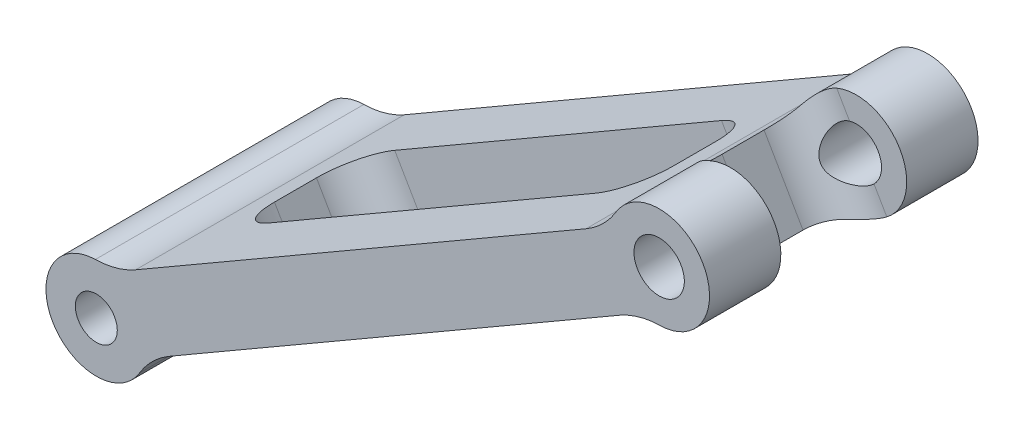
ISO-10303-21;
HEADER;
FILE_DESCRIPTION(('STEP AP214'),'2;1');
FILE_NAME('part.step','',(''),(''),'','','');
FILE_SCHEMA(('AUTOMOTIVE_DESIGN { 1 0 10303 214 1 1 1 1 }'));
ENDSEC;
DATA;
#1=APPLICATION_CONTEXT('core data for automotive mechanical design processes');
#2=APPLICATION_PROTOCOL_DEFINITION('international standard','automotive_design',2000,#1);
#3=PRODUCT_CONTEXT('',#1,'mechanical');
#4=PRODUCT('Part','Part','',(#3));
#5=PRODUCT_RELATED_PRODUCT_CATEGORY('part','',(#4));
#6=PRODUCT_DEFINITION_FORMATION('','',#4);
#7=PRODUCT_DEFINITION_CONTEXT('part definition',#1,'design');
#8=PRODUCT_DEFINITION('design','',#6,#7);
#9=PRODUCT_DEFINITION_SHAPE('','',#8);
#10=(LENGTH_UNIT() NAMED_UNIT(*) SI_UNIT(.MILLI.,.METRE.));
#11=(NAMED_UNIT(*) PLANE_ANGLE_UNIT() SI_UNIT($,.RADIAN.));
#12=(NAMED_UNIT(*) SI_UNIT($,.STERADIAN.) SOLID_ANGLE_UNIT());
#13=UNCERTAINTY_MEASURE_WITH_UNIT(LENGTH_MEASURE(1.E-05),#10,'distance_accuracy_value','');
#14=(GEOMETRIC_REPRESENTATION_CONTEXT(3) GLOBAL_UNCERTAINTY_ASSIGNED_CONTEXT((#13)) GLOBAL_UNIT_ASSIGNED_CONTEXT((#10,
#11,#12)) REPRESENTATION_CONTEXT('',''));
#15=CARTESIAN_POINT('',(0.,0.,0.));
#16=DIRECTION('',(0.,0.,1.));
#17=DIRECTION('',(1.,0.,0.));
#18=AXIS2_PLACEMENT_3D('',#15,#16,#17);
#19=CARTESIAN_POINT('',(-50.403016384,254.245736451,-16.));
#20=DIRECTION('',(0.,0.,-1.));
#21=DIRECTION('',(-0.865433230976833,-0.501024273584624,0.));
#22=AXIS2_PLACEMENT_3D('',#19,#20,#21);
#23=PLANE('',#22);
#24=CARTESIAN_POINT('',(-59.10260396,256.225433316,-16.));
#25=DIRECTION('',(0.,0.,-1.));
#26=DIRECTION('',(-1.,0.,0.));
#27=AXIS2_PLACEMENT_3D('',#24,#25,#26);
#28=CIRCLE('',#27,5.99999999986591);
#29=CARTESIAN_POINT('',(-64.2468377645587,259.313613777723,-16.));
#30=VERTEX_POINT('',#29);
#31=CARTESIAN_POINT('',(-58.9860828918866,250.226564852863,-16.));
#32=VERTEX_POINT('',#31);
#33=EDGE_CURVE('E385',#30,#32,#28,.T.);
#34=ORIENTED_EDGE('',*,*,#33,.T.);
#35=CARTESIAN_POINT('',(-58.791881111,240.228450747,-16.));
#36=DIRECTION('',(0.,0.,-1.));
#37=DIRECTION('',(-1.,0.,0.));
#38=AXIS2_PLACEMENT_3D('',#35,#36,#37);
#39=CIRCLE('',#38,10.0000000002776);
#40=CARTESIAN_POINT('',(-63.8021238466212,248.882783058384,-16.));
#41=VERTEX_POINT('',#40);
#42=EDGE_CURVE('E382',#32,#41,#39,.F.);
#43=ORIENTED_EDGE('',*,*,#42,.T.);
#44=DIRECTION('',(-0.865433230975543,-0.501024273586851,0.));
#45=VECTOR('',#44,1.);
#46=CARTESIAN_POINT('',(-90.6366408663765,233.347506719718,-16.));
#47=LINE('',#46,#45);
#48=CARTESIAN_POINT('',(-117.471157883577,217.812230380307,-16.));
#49=VERTEX_POINT('',#48);
#50=EDGE_CURVE('E315',#41,#49,#47,.T.);
#51=ORIENTED_EDGE('',*,*,#50,.T.);
#52=CARTESIAN_POINT('',(-112.460915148,209.157898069,-16.));
#53=DIRECTION('',(0.,0.,-1.));
#54=DIRECTION('',(-1.,0.,0.));
#55=AXIS2_PLACEMENT_3D('',#52,#53,#54);
#56=CIRCLE('',#55,10.0000000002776);
#57=CARTESIAN_POINT('',(-121.0346381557,214.304865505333,-16.));
#58=VERTEX_POINT('',#57);
#59=EDGE_CURVE('E395',#49,#58,#56,.F.);
#60=ORIENTED_EDGE('',*,*,#59,.T.);
#61=CARTESIAN_POINT('',(-126.17887196,217.393045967,-16.));
#62=DIRECTION('',(0.,0.,-1.));
#63=DIRECTION('',(-1.,0.,0.));
#64=AXIS2_PLACEMENT_3D('',#61,#62,#63);
#65=CIRCLE('',#64,5.99999999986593);
#66=CARTESIAN_POINT('',(-126.295393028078,223.391914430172,-16.));
#67=VERTEX_POINT('',#66);
#68=EDGE_CURVE('E45',#58,#67,#65,.T.);
#69=ORIENTED_EDGE('',*,*,#68,.T.);
#70=CARTESIAN_POINT('',(-126.489594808,233.390028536,-16.));
#71=DIRECTION('',(0.,0.,-1.));
#72=DIRECTION('',(-1.,0.,0.));
#73=AXIS2_PLACEMENT_3D('',#70,#71,#72);
#74=CIRCLE('',#73,10.0000000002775);
#75=CARTESIAN_POINT('',(-121.479352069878,224.735696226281,-16.));
#76=VERTEX_POINT('',#75);
#77=EDGE_CURVE('E392',#67,#76,#74,.F.);
#78=ORIENTED_EDGE('',*,*,#77,.T.);
#79=DIRECTION('',(0.865433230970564,0.501024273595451,0.));
#80=VECTOR('',#79,1.);
#81=CARTESIAN_POINT('',(-94.6448350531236,240.270972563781,-16.));
#82=LINE('',#81,#80);
#83=CARTESIAN_POINT('',(-67.8103180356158,255.806248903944,-16.));
#84=VERTEX_POINT('',#83);
#85=EDGE_CURVE('E391',#76,#84,#82,.T.);
#86=ORIENTED_EDGE('',*,*,#85,.T.);
#87=CARTESIAN_POINT('',(-72.820560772,264.460581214,-16.));
#88=DIRECTION('',(0.,0.,-1.));
#89=DIRECTION('',(-1.,0.,0.));
#90=AXIS2_PLACEMENT_3D('',#87,#88,#89);
#91=CIRCLE('',#90,9.99999999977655);
#92=EDGE_CURVE('E388',#84,#30,#91,.F.);
#93=ORIENTED_EDGE('',*,*,#92,.T.);
#94=EDGE_LOOP('',(#34,#43,#51,#60,#69,#78,#86,#93));
#95=FACE_BOUND('',#94,.T.);
#96=CARTESIAN_POINT('',(-59.10260396,256.225433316,-16.));
#97=DIRECTION('',(0.,0.,-1.));
#98=DIRECTION('',(-1.,0.,0.));
#99=AXIS2_PLACEMENT_3D('',#96,#97,#98);
#100=CIRCLE('',#99,3.00000000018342);
#101=CARTESIAN_POINT('',(-62.1026039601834,256.225433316,-16.));
#102=VERTEX_POINT('',#101);
#103=EDGE_CURVE('E321',#102,#102,#100,.F.);
#104=ORIENTED_EDGE('',*,*,#103,.T.);
#105=EDGE_LOOP('',(#104));
#106=FACE_BOUND('',#105,.T.);
#107=CARTESIAN_POINT('',(-126.17887196,217.393045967,-16.));
#108=DIRECTION('',(0.,0.,1.));
#109=DIRECTION('',(1.,0.,0.));
#110=AXIS2_PLACEMENT_3D('',#107,#108,#109);
#111=CIRCLE('',#110,2.49999999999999);
#112=CARTESIAN_POINT('',(-123.67887196,217.393045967,-16.));
#113=VERTEX_POINT('',#112);
#114=EDGE_CURVE('E762',#113,#113,#111,.T.);
#115=ORIENTED_EDGE('',*,*,#114,.T.);
#116=EDGE_LOOP('',(#115));
#117=FACE_BOUND('',#116,.T.);
#118=ADVANCED_FACE('F35',(#95,#106,#117),#23,.T.);
#119=CARTESIAN_POINT('',(-55.437575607,251.385673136,-7.5));
#120=DIRECTION('',(0.,0.,1.));
#121=DIRECTION('',(0.865433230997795,0.501024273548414,0.));
#122=AXIS2_PLACEMENT_3D('',#119,#120,#121);
#123=PLANE('',#122);
#124=DIRECTION('',(0.501024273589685,-0.865433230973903,0.));
#125=VECTOR('',#124,1.);
#126=CARTESIAN_POINT('',(-58.4548701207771,256.59753027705,-7.5));
#127=LINE('',#126,#125);
#128=CARTESIAN_POINT('',(-59.911856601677,259.114223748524,-7.49999999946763));
#129=VERTEX_POINT('',#128);
#130=CARTESIAN_POINT('',(-61.4388819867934,261.751897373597,-7.50000000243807));
#131=VERTEX_POINT('',#130);
#132=EDGE_CURVE('E163',#129,#131,#127,.F.);
#133=ORIENTED_EDGE('',*,*,#132,.F.);
#134=CARTESIAN_POINT('',(-59.10260396,256.225433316,-7.49999999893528));
#135=DIRECTION('',(0.,0.,-1.));
#136=DIRECTION('',(-1.,0.,0.));
#137=AXIS2_PLACEMENT_3D('',#134,#135,#136);
#138=CIRCLE('',#137,3.00000000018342);
#139=CARTESIAN_POINT('',(-57.0003940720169,254.08517314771,-7.49999999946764));
#140=VERTEX_POINT('',#139);
#141=EDGE_CURVE('E185',#140,#129,#138,.F.);
#142=ORIENTED_EDGE('',*,*,#141,.F.);
#143=DIRECTION('',(0.501024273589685,-0.865433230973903,0.));
#144=VECTOR('',#143,1.);
#145=CARTESIAN_POINT('',(-58.4548701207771,256.59753027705,-7.5));
#146=LINE('',#145,#144);
#147=CARTESIAN_POINT('',(-55.473368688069,251.447499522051,-7.50000000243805));
#148=VERTEX_POINT('',#147);
#149=EDGE_CURVE('E157',#148,#140,#146,.F.);
#150=ORIENTED_EDGE('',*,*,#149,.F.);
#151=CARTESIAN_POINT('',(-59.10260396,256.225433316,-7.50000000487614));
#152=DIRECTION('',(0.,0.,-1.));
#153=DIRECTION('',(-1.,0.,0.));
#154=AXIS2_PLACEMENT_3D('',#151,#152,#153);
#155=CIRCLE('',#154,5.99999999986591);
#156=EDGE_CURVE('E39',#148,#131,#155,.F.);
#157=ORIENTED_EDGE('',*,*,#156,.T.);
#158=EDGE_LOOP('',(#133,#142,#150,#157));
#159=FACE_BOUND('',#158,.T.);
#160=ADVANCED_FACE('F162',(#159),#123,.T.);
#161=CARTESIAN_POINT('',(-60.4636101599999,250.087726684,2.5));
#162=DIRECTION('',(0.865433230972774,0.501024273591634,0.));
#163=DIRECTION('',(0.,0.,-1.));
#164=AXIS2_PLACEMENT_3D('',#161,#162,#163);
#165=PLANE('',#164);
#166=DIRECTION('',(0.501024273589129,-0.865433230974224,-2.5687770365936E-11));
#167=VECTOR('',#166,1.);
#168=CARTESIAN_POINT('',(-62.7813431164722,254.091211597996,2.50000000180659));
#169=LINE('',#168,#167);
#170=CARTESIAN_POINT('',(-60.4636101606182,250.087726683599,2.50000000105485));
#171=VERTEX_POINT('',#170);
#172=CARTESIAN_POINT('',(-65.1029728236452,258.101427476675,2.50000000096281));
#173=VERTEX_POINT('',#172);
#174=EDGE_CURVE('E332',#171,#173,#169,.F.);
#175=ORIENTED_EDGE('',*,*,#174,.F.);
#176=DIRECTION('',(0.,0.,-1.));
#177=VECTOR('',#176,1.);
#178=CARTESIAN_POINT('',(-60.4636101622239,250.087726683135,0.));
#179=LINE('',#178,#177);
#180=CARTESIAN_POINT('',(-60.4636101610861,250.087726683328,-2.49999999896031));
#181=VERTEX_POINT('',#180);
#182=EDGE_CURVE('E355',#181,#171,#179,.F.);
#183=ORIENTED_EDGE('',*,*,#182,.F.);
#184=DIRECTION('',(-0.501024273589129,0.865433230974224,6.41878885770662E-13));
#185=VECTOR('',#184,1.);
#186=CARTESIAN_POINT('',(-62.7820362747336,254.092408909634,-2.49999999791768));
#187=LINE('',#186,#185);
#188=CARTESIAN_POINT('',(-65.1029728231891,258.101427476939,-2.49999999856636));
#189=VERTEX_POINT('',#188);
#190=EDGE_CURVE('E175',#189,#181,#187,.F.);
#191=ORIENTED_EDGE('',*,*,#190,.F.);
#192=DIRECTION('',(0.,0.,1.));
#193=VECTOR('',#192,1.);
#194=CARTESIAN_POINT('',(-65.1029728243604,258.101427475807,0.));
#195=LINE('',#194,#193);
#196=EDGE_CURVE('E297',#173,#189,#195,.F.);
#197=ORIENTED_EDGE('',*,*,#196,.F.);
#198=EDGE_LOOP('',(#175,#183,#191,#197));
#199=FACE_BOUND('',#198,.T.);
#200=ADVANCED_FACE('F204',(#199),#165,.T.);
#201=CARTESIAN_POINT('',(-61.4987831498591,261.855366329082,-2.5));
#202=DIRECTION('',(0.501024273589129,-0.865433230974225,0.));
#203=DIRECTION('',(0.865433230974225,0.501024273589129,0.));
#204=AXIS2_PLACEMENT_3D('',#201,#202,#203);
#205=CYLINDRICAL_SURFACE('',#204,5.);
#206=ORIENTED_EDGE('',*,*,#149,.T.);
#207=CARTESIAN_POINT('',(-59.911856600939,259.11422374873,-7.49999999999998));
#208=CARTESIAN_POINT('',(-59.9841684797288,259.093980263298,-7.50001375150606));
#209=CARTESIAN_POINT('',(-60.0557126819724,259.070996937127,-7.49841369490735));
#210=CARTESIAN_POINT('',(-60.196734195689,259.019799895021,-7.49190132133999));
#211=CARTESIAN_POINT('',(-60.2662118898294,258.991587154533,-7.48698962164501));
#212=CARTESIAN_POINT('',(-60.4022792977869,258.93031554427,-7.47380010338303));
#213=CARTESIAN_POINT('',(-60.4688809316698,258.897279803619,-7.46553803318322));
#214=CARTESIAN_POINT('',(-60.5990552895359,258.826611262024,-7.44567775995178));
#215=CARTESIAN_POINT('',(-60.6626280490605,258.788978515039,-7.43407959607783));
#216=CARTESIAN_POINT('',(-60.8481420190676,258.669741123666,-7.3943943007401));
#217=CARTESIAN_POINT('',(-60.9650328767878,258.581727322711,-7.36140137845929));
#218=CARTESIAN_POINT('',(-61.1826974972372,258.392027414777,-7.28384918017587));
#219=CARTESIAN_POINT('',(-61.2834583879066,258.290330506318,-7.23928074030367));
#220=CARTESIAN_POINT('',(-61.4720708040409,258.071369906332,-7.13841921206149));
#221=CARTESIAN_POINT('',(-61.5590826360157,257.953596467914,-7.0816700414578));
#222=CARTESIAN_POINT('',(-61.7137943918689,257.709548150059,-6.96070453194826));
#223=CARTESIAN_POINT('',(-61.7814833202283,257.58326848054,-6.89648397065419));
#224=CARTESIAN_POINT('',(-61.9076117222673,257.3022597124,-6.75215582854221));
#225=CARTESIAN_POINT('',(-61.962484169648,257.146361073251,-6.67121058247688));
#226=CARTESIAN_POINT('',(-62.0460518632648,256.828114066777,-6.50819447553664));
#227=CARTESIAN_POINT('',(-62.0747243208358,256.665760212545,-6.42612269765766));
#228=CARTESIAN_POINT('',(-62.1037772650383,256.350772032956,-6.27418716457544));
#229=CARTESIAN_POINT('',(-62.1064530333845,256.198562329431,-6.20388744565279));
#230=CARTESIAN_POINT('',(-62.0878691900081,255.891042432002,-6.07384392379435));
#231=CARTESIAN_POINT('',(-62.066648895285,255.735737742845,-6.01408296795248));
#232=CARTESIAN_POINT('',(-62.0071692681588,255.465658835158,-5.92681612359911));
#233=CARTESIAN_POINT('',(-61.9748778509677,255.350994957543,-5.89496023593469));
#234=CARTESIAN_POINT('',(-61.8956036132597,255.123846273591,-5.84543514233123));
#235=CARTESIAN_POINT('',(-61.8486709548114,255.011355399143,-5.82771822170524));
#236=CARTESIAN_POINT('',(-61.7798590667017,254.871378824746,-5.81578752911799));
#237=CARTESIAN_POINT('',(-61.7643929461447,254.841225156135,-5.81384181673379));
#238=CARTESIAN_POINT('',(-61.7324202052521,254.78140632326,-5.81124146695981));
#239=CARTESIAN_POINT('',(-61.7159133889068,254.751741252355,-5.81058707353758));
#240=CARTESIAN_POINT('',(-61.6643339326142,254.662648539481,-5.81058900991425));
#241=CARTESIAN_POINT('',(-61.6276869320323,254.604110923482,-5.8132958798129));
#242=CARTESIAN_POINT('',(-61.5506689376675,254.490001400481,-5.82398114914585));
#243=CARTESIAN_POINT('',(-61.5102949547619,254.43443193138,-5.83196381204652));
#244=CARTESIAN_POINT('',(-61.4262070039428,254.326603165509,-5.85282165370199));
#245=CARTESIAN_POINT('',(-61.3824839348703,254.274353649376,-5.86571057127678));
#246=CARTESIAN_POINT('',(-61.2922588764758,254.173606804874,-5.89579239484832));
#247=CARTESIAN_POINT('',(-61.2457551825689,254.125111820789,-5.91298796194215));
#248=CARTESIAN_POINT('',(-61.1040920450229,253.986845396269,-5.96948287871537));
#249=CARTESIAN_POINT('',(-61.005503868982,253.902679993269,-6.01404033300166));
#250=CARTESIAN_POINT('',(-60.8015474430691,253.749569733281,-6.11228160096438));
#251=CARTESIAN_POINT('',(-60.6961776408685,253.680628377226,-6.16596750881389));
#252=CARTESIAN_POINT('',(-60.5067639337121,253.572685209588,-6.26448965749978));
#253=CARTESIAN_POINT('',(-60.4239242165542,253.530500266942,-6.30821162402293));
#254=CARTESIAN_POINT('',(-60.255386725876,253.4542146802,-6.39724693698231));
#255=CARTESIAN_POINT('',(-60.1696880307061,253.420116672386,-6.44256079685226));
#256=CARTESIAN_POINT('',(-59.9955911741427,253.359936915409,-6.53369749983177));
#257=CARTESIAN_POINT('',(-59.9071887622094,253.333868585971,-6.5795210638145));
#258=CARTESIAN_POINT('',(-59.7280843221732,253.289913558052,-6.6706094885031));
#259=CARTESIAN_POINT('',(-59.6373822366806,253.272027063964,-6.71587433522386));
#260=CARTESIAN_POINT('',(-59.4533864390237,253.244550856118,-6.80523238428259));
#261=CARTESIAN_POINT('',(-59.3600794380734,253.235017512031,-6.84931570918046));
#262=CARTESIAN_POINT('',(-59.1719055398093,253.224754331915,-6.93510549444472));
#263=CARTESIAN_POINT('',(-59.0770388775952,253.22402318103,-6.97681230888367));
#264=CARTESIAN_POINT('',(-58.8864977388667,253.231712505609,-7.0569183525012));
#265=CARTESIAN_POINT('',(-58.7908254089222,253.240113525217,-7.09532442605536));
#266=CARTESIAN_POINT('',(-58.5992872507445,253.266375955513,-7.16808289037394));
#267=CARTESIAN_POINT('',(-58.5034215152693,253.284233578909,-7.20243689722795));
#268=CARTESIAN_POINT('',(-58.2664978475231,253.340644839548,-7.28166333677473));
#269=CARTESIAN_POINT('',(-58.1257989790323,253.385015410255,-7.32368679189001));
#270=CARTESIAN_POINT('',(-57.8499178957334,253.49545000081,-7.39495235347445));
#271=CARTESIAN_POINT('',(-57.7147290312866,253.561486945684,-7.42421030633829));
#272=CARTESIAN_POINT('',(-57.4792920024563,253.699620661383,-7.46447389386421));
#273=CARTESIAN_POINT('',(-57.3773314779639,253.76809623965,-7.47791059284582));
#274=CARTESIAN_POINT('',(-57.2308484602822,253.880154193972,-7.49123860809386));
#275=CARTESIAN_POINT('',(-57.1830372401,253.919122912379,-7.49454327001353));
#276=CARTESIAN_POINT('',(-57.0898386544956,253.99999297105,-7.49892603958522));
#277=CARTESIAN_POINT('',(-57.044451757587,254.041894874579,-7.50000371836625));
#278=CARTESIAN_POINT('',(-57.0003940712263,254.085173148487,-7.49999999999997));
#279=B_SPLINE_CURVE_WITH_KNOTS('',3,(#207,#208,#209,#210,#211,#212,#213,#214,#215,#216,#217,
#218,#219,#220,#221,#222,#223,#224,#225,#226,#227,#228,#229,#230,#231,#232,#233,#234,#235,#236,
#237,#238,#239,#240,#241,#242,#243,#244,#245,#246,#247,#248,#249,#250,#251,#252,#253,#254,#255,
#256,#257,#258,#259,#260,#261,#262,#263,#264,#265,#266,#267,#268,#269,#270,#271,#272,#273,#274,
#275,#276,#277,#278),.UNSPECIFIED.,.F.,.F.,(4,2,2,2,2,2,2,2,2,2,2,2,2,2,2,2,2,2,2,2,2,2,2,2,2,2,
2,2,2,2,2,2,2,2,2,4),(0.,0.225203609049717,0.450365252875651,0.674480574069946,
0.898593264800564,1.34631593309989,1.79439413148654,2.26373923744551,2.73335088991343,
3.28335419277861,3.83383543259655,4.3352191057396,4.83577903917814,5.2043570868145,
5.571685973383,5.67349034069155,5.77531393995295,5.98225503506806,6.18936356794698,
6.39705637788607,6.6048778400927,7.01434620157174,7.42390862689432,7.73173635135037,
8.03966428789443,8.34810409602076,8.65655160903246,8.96706493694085,9.27753188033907,
9.5873386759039,9.89702149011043,10.3551126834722,10.8126335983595,11.1819714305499,
11.3671383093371,11.5523408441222),.UNSPECIFIED.);
#280=EDGE_CURVE('E174',#129,#140,#279,.T.);
#281=ORIENTED_EDGE('',*,*,#280,.F.);
#282=ORIENTED_EDGE('',*,*,#132,.T.);
#283=CARTESIAN_POINT('',(-61.4388819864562,261.75189737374,-7.49999999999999));
#284=CARTESIAN_POINT('',(-61.5455358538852,261.70683950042,-7.50002640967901));
#285=CARTESIAN_POINT('',(-61.650861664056,261.658647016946,-7.4960419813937));
#286=CARTESIAN_POINT('',(-61.8580333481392,261.556554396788,-7.48006966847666));
#287=CARTESIAN_POINT('',(-61.9598805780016,261.502656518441,-7.46808494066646));
#288=CARTESIAN_POINT('',(-62.1584323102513,261.390201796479,-7.43627831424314));
#289=CARTESIAN_POINT('',(-62.255175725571,261.331692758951,-7.41653007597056));
#290=CARTESIAN_POINT('',(-62.443895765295,261.210245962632,-7.36938262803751));
#291=CARTESIAN_POINT('',(-62.53587225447,261.147308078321,-7.3419832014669));
#292=CARTESIAN_POINT('',(-62.7144524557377,261.017791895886,-7.27985453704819));
#293=CARTESIAN_POINT('',(-62.8010625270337,260.951218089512,-7.24513419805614));
#294=CARTESIAN_POINT('',(-62.9687018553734,260.81509193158,-7.16871061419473));
#295=CARTESIAN_POINT('',(-63.0497289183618,260.745538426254,-7.12700464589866));
#296=CARTESIAN_POINT('',(-63.2846006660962,260.533041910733,-6.99170755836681));
#297=CARTESIAN_POINT('',(-63.4297096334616,260.386650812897,-6.88812363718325));
#298=CARTESIAN_POINT('',(-63.702310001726,260.083699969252,-6.65256947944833));
#299=CARTESIAN_POINT('',(-63.8286646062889,259.926984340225,-6.519500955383));
#300=CARTESIAN_POINT('',(-63.9992708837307,259.694131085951,-6.30406303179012));
#301=CARTESIAN_POINT('',(-64.052868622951,259.617083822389,-6.22982781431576));
#302=CARTESIAN_POINT('',(-64.154180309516,259.464256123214,-6.07632135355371));
#303=CARTESIAN_POINT('',(-64.2018978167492,259.388474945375,-5.99705320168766));
#304=CARTESIAN_POINT('',(-64.2468377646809,259.313613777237,-5.91537891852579));
#305=B_SPLINE_CURVE_WITH_KNOTS('',3,(#283,#284,#285,#286,#287,#288,#289,#290,#291,#292,#293,
#294,#295,#296,#297,#298,#299,#300,#301,#302,#303,#304),.UNSPECIFIED.,.F.,.F.,(4,2,2,2,2,2,2,2,
2,2,4),(0.,0.347219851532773,0.694302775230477,1.03816910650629,1.38204518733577,
1.7255056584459,2.06910034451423,2.75830534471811,3.47964289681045,3.83842270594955,
4.1969842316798),.UNSPECIFIED.);
#306=CARTESIAN_POINT('',(-64.2468377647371,259.313613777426,-5.91537891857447));
#307=VERTEX_POINT('',#306);
#308=EDGE_CURVE('E166',#131,#307,#305,.T.);
#309=ORIENTED_EDGE('',*,*,#308,.T.);
#310=CARTESIAN_POINT('',(-65.1029728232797,258.101427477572,-2.49999999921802));
#311=CARTESIAN_POINT('',(-65.1029953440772,258.101430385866,-2.63101334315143));
#312=CARTESIAN_POINT('',(-65.0994789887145,258.105668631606,-2.76202587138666));
#313=CARTESIAN_POINT('',(-65.0855299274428,258.122638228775,-3.0231328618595));
#314=CARTESIAN_POINT('',(-65.0750970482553,258.135369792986,-3.15322730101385));
#315=CARTESIAN_POINT('',(-65.0474735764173,258.169351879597,-3.41160102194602));
#316=CARTESIAN_POINT('',(-65.0302816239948,258.190604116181,-3.53987993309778));
#317=CARTESIAN_POINT('',(-64.9894622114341,258.24166090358,-3.79367569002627));
#318=CARTESIAN_POINT('',(-64.9658350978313,258.271464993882,-3.91919268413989));
#319=CARTESIAN_POINT('',(-64.9125498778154,258.339695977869,-4.16672151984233));
#320=CARTESIAN_POINT('',(-64.8828844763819,258.378133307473,-4.28872891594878));
#321=CARTESIAN_POINT('',(-64.8181059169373,258.463616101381,-4.52819696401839));
#322=CARTESIAN_POINT('',(-64.782992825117,258.510661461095,-4.64565767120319));
#323=CARTESIAN_POINT('',(-64.7080613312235,258.613241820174,-4.87500889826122));
#324=CARTESIAN_POINT('',(-64.6682503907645,258.668763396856,-4.98690786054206));
#325=CARTESIAN_POINT('',(-64.5846833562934,258.788224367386,-5.20451079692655));
#326=CARTESIAN_POINT('',(-64.5409288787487,258.852160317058,-5.31021728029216));
#327=CARTESIAN_POINT('',(-64.4560713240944,258.979667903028,-5.50183855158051));
#328=CARTESIAN_POINT('',(-64.4153321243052,259.042264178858,-5.58856618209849));
#329=CARTESIAN_POINT('',(-64.3321869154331,259.173469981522,-5.7563129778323));
#330=CARTESIAN_POINT('',(-64.2897828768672,259.242072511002,-5.83733859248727));
#331=CARTESIAN_POINT('',(-64.2468377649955,259.313613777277,-5.91537891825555));
#332=B_SPLINE_CURVE_WITH_KNOTS('',3,(#310,#311,#312,#313,#314,#315,#316,#317,#318,#319,#320,
#321,#322,#323,#324,#325,#326,#327,#328,#329,#330,#331),.UNSPECIFIED.,.F.,.F.,(4,2,2,2,2,2,2,2,
2,2,4),(0.,0.392923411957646,0.785856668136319,1.17886901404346,1.57186020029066,
1.96532901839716,2.35879305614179,2.75164035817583,3.14432735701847,3.48738101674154,
3.83004020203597),.UNSPECIFIED.);
#333=EDGE_CURVE('E213',#189,#307,#332,.T.);
#334=ORIENTED_EDGE('',*,*,#333,.F.);
#335=ORIENTED_EDGE('',*,*,#190,.T.);
#336=CARTESIAN_POINT('',(-58.9860828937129,250.226564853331,-5.91537891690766));
#337=CARTESIAN_POINT('',(-59.0815164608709,250.224714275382,-5.82612117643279));
#338=CARTESIAN_POINT('',(-59.1732572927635,250.221562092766,-5.73294037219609));
#339=CARTESIAN_POINT('',(-59.348636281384,250.213325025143,-5.53932625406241));
#340=CARTESIAN_POINT('',(-59.4322746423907,250.208240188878,-5.43889312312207));
#341=CARTESIAN_POINT('',(-59.5907109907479,250.1968099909,-5.23139664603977));
#342=CARTESIAN_POINT('',(-59.6655118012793,250.190465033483,-5.12433543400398));
#343=CARTESIAN_POINT('',(-59.8057385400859,250.177171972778,-4.90428554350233));
#344=CARTESIAN_POINT('',(-59.8711650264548,250.170223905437,-4.79129721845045));
#345=CARTESIAN_POINT('',(-59.9922492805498,250.15633250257,-4.56007674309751));
#346=CARTESIAN_POINT('',(-60.0478984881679,250.149389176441,-4.44184011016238));
#347=CARTESIAN_POINT('',(-60.1490148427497,250.136063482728,-4.2010595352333));
#348=CARTESIAN_POINT('',(-60.19448190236,250.129681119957,-4.07851555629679));
#349=CARTESIAN_POINT('',(-60.2749284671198,250.117951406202,-3.83016241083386));
#350=CARTESIAN_POINT('',(-60.3099215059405,250.112602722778,-3.70435768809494));
#351=CARTESIAN_POINT('',(-60.3693136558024,250.10329791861,-3.45027100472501));
#352=CARTESIAN_POINT('',(-60.3937169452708,250.099341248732,-3.32199004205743));
#353=CARTESIAN_POINT('',(-60.4297134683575,250.093429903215,-3.07819086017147));
#354=CARTESIAN_POINT('',(-60.4424301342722,250.09130142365,-2.96284119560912));
#355=CARTESIAN_POINT('',(-60.4593748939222,250.088444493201,-2.7316623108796));
#356=CARTESIAN_POINT('',(-60.4636146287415,250.087714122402,-2.61583396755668));
#357=CARTESIAN_POINT('',(-60.4636101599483,250.087726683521,-2.49999999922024));
#358=B_SPLINE_CURVE_WITH_KNOTS('',3,(#336,#337,#338,#339,#340,#341,#342,#343,#344,#345,#346,
#347,#348,#349,#350,#351,#352,#353,#354,#355,#356,#357),.UNSPECIFIED.,.F.,.F.,(4,2,2,2,2,2,2,2,
2,2,4),(0.,0.391934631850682,0.78385937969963,1.17565858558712,1.56743445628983,
1.95955163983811,2.35167218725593,2.74328385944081,3.13474087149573,3.48263012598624,
3.830041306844),.UNSPECIFIED.);
#359=CARTESIAN_POINT('',(-58.9860828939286,250.226564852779,-5.91537891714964));
#360=VERTEX_POINT('',#359);
#361=EDGE_CURVE('E221',#360,#181,#358,.T.);
#362=ORIENTED_EDGE('',*,*,#361,.F.);
#363=CARTESIAN_POINT('',(-58.9860828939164,250.226564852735,-5.9153789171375));
#364=CARTESIAN_POINT('',(-58.8871281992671,250.228479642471,-6.00796097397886));
#365=CARTESIAN_POINT('',(-58.7853213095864,250.232913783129,-6.09749049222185));
#366=CARTESIAN_POINT('',(-58.5765915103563,250.247620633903,-6.27004717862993));
#367=CARTESIAN_POINT('',(-58.4696640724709,250.257898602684,-6.35306841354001));
#368=CARTESIAN_POINT('',(-58.2504429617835,250.285219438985,-6.51278536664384));
#369=CARTESIAN_POINT('',(-58.1381084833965,250.302324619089,-6.58941473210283));
#370=CARTESIAN_POINT('',(-57.9098415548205,250.344041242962,-6.73483426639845));
#371=CARTESIAN_POINT('',(-57.7939100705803,250.368650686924,-6.80362651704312));
#372=CARTESIAN_POINT('',(-57.5585098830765,250.426247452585,-6.93316501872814));
#373=CARTESIAN_POINT('',(-57.439021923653,250.459292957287,-6.99385074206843));
#374=CARTESIAN_POINT('',(-57.1984333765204,250.534211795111,-7.10583838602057));
#375=CARTESIAN_POINT('',(-57.0773331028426,250.576083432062,-7.15714210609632));
#376=CARTESIAN_POINT('',(-56.8354548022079,250.668752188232,-7.24939097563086));
#377=CARTESIAN_POINT('',(-56.7146787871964,250.719497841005,-7.29039270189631));
#378=CARTESIAN_POINT('',(-56.4742594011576,250.830128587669,-7.36176682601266));
#379=CARTESIAN_POINT('',(-56.3546154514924,250.890008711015,-7.39214497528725));
#380=CARTESIAN_POINT('',(-56.1048361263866,251.025845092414,-7.44458191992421));
#381=CARTESIAN_POINT('',(-55.974990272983,251.102844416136,-7.46536191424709));
#382=CARTESIAN_POINT('',(-55.7839294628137,251.226213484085,-7.48615142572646));
#383=CARTESIAN_POINT('',(-55.7207327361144,251.26874507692,-7.49135111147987));
#384=CARTESIAN_POINT('',(-55.5958563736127,251.356291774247,-7.49827680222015));
#385=CARTESIAN_POINT('',(-55.5341772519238,251.401307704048,-7.50000164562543));
#386=CARTESIAN_POINT('',(-55.4733686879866,251.447499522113,-7.49999999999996));
#387=B_SPLINE_CURVE_WITH_KNOTS('',3,(#363,#364,#365,#366,#367,#368,#369,#370,#371,#372,#373,
#374,#375,#376,#377,#378,#379,#380,#381,#382,#383,#384,#385,#386),.UNSPECIFIED.,.F.,.F.,(4,2,2,
2,2,2,2,2,2,2,2,4),(0.,0.406538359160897,0.81344312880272,1.22414993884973,1.63474739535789,
2.04825705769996,2.46168732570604,2.87279487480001,3.28367951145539,3.73965449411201,
3.96859807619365,4.19761817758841),.UNSPECIFIED.);
#388=EDGE_CURVE('E184',#360,#148,#387,.T.);
#389=ORIENTED_EDGE('',*,*,#388,.T.);
#390=EDGE_LOOP('',(#206,#281,#282,#309,#334,#335,#362,#389));
#391=FACE_BOUND('',#390,.T.);
#392=ADVANCED_FACE('F170',(#391),#205,.F.);
#393=CARTESIAN_POINT('',(-71.164393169,244.620552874,7.5));
#394=DIRECTION('',(0.,0.,-1.));
#395=DIRECTION('',(-0.865433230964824,-0.501024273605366,0.));
#396=AXIS2_PLACEMENT_3D('',#393,#394,#395);
#397=PLANE('',#396);
#398=DIRECTION('',(0.865433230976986,0.501024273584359,0.));
#399=VECTOR('',#398,1.);
#400=CARTESIAN_POINT('',(-94.6448350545,240.270972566,7.5));
#401=LINE('',#400,#399);
#402=CARTESIAN_POINT('',(-114.117082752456,228.997926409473,7.5));
#403=VERTEX_POINT('',#402);
#404=CARTESIAN_POINT('',(-75.1725873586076,251.544018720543,7.5));
#405=VERTEX_POINT('',#404);
#406=EDGE_CURVE('E416',#403,#405,#401,.T.);
#407=ORIENTED_EDGE('',*,*,#406,.T.);
#408=DIRECTION('',(0.501024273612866,-0.865433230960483,0.));
#409=VECTOR('',#408,1.);
#410=CARTESIAN_POINT('',(-73.1684902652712,248.082285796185,7.5));
#411=LINE('',#410,#409);
#412=CARTESIAN_POINT('',(-71.1643931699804,244.620552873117,7.50000000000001));
#413=VERTEX_POINT('',#412);
#414=EDGE_CURVE('E347',#413,#405,#411,.F.);
#415=ORIENTED_EDGE('',*,*,#414,.F.);
#416=DIRECTION('',(-0.865433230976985,-0.50102427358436,0.));
#417=VECTOR('',#416,1.);
#418=CARTESIAN_POINT('',(-90.6366408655,233.347506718,7.50000000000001));
#419=LINE('',#418,#417);
#420=CARTESIAN_POINT('',(-110.108888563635,222.074460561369,7.5));
#421=VERTEX_POINT('',#420);
#422=EDGE_CURVE('E488',#413,#421,#419,.T.);
#423=ORIENTED_EDGE('',*,*,#422,.T.);
#424=DIRECTION('',(-0.501024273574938,0.86543323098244,0.));
#425=VECTOR('',#424,1.);
#426=CARTESIAN_POINT('',(-112.11298565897,225.53619348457,7.5));
#427=LINE('',#426,#425);
#428=EDGE_CURVE('E328',#403,#421,#427,.F.);
#429=ORIENTED_EDGE('',*,*,#428,.F.);
#430=EDGE_LOOP('',(#407,#415,#423,#429));
#431=FACE_BOUND('',#430,.T.);
#432=ADVANCED_FACE('F203',(#431),#397,.T.);
#433=CARTESIAN_POINT('',(-75.172587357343,251.544018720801,2.5));
#434=DIRECTION('',(0.501024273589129,-0.865433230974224,0.));
#435=DIRECTION('',(0.865433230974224,0.501024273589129,0.));
#436=AXIS2_PLACEMENT_3D('',#433,#434,#435);
#437=CYLINDRICAL_SURFACE('',#436,5.);
#438=CARTESIAN_POINT('',(-75.172587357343,251.544018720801,2.5));
#439=DIRECTION('',(0.501024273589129,-0.865433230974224,0.));
#440=DIRECTION('',(0.865433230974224,0.501024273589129,0.));
#441=AXIS2_PLACEMENT_3D('',#438,#439,#440);
#442=CIRCLE('',#441,5.);
#443=CARTESIAN_POINT('',(-70.8454212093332,254.049140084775,2.5));
#444=VERTEX_POINT('',#443);
#445=EDGE_CURVE('E423',#405,#444,#442,.F.);
#446=ORIENTED_EDGE('',*,*,#445,.T.);
#447=DIRECTION('',(-0.501024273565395,0.865433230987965,0.));
#448=VECTOR('',#447,1.);
#449=CARTESIAN_POINT('',(-68.841324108,250.5874071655,2.5));
#450=LINE('',#449,#448);
#451=CARTESIAN_POINT('',(-66.8372270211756,247.125674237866,2.49999999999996));
#452=VERTEX_POINT('',#451);
#453=EDGE_CURVE('E344',#452,#444,#450,.T.);
#454=ORIENTED_EDGE('',*,*,#453,.F.);
#455=CARTESIAN_POINT('',(-71.1643931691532,244.620552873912,2.49999999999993));
#456=DIRECTION('',(0.501024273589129,-0.865433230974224,0.));
#457=DIRECTION('',(0.865433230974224,0.501024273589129,0.));
#458=AXIS2_PLACEMENT_3D('',#455,#456,#457);
#459=CIRCLE('',#458,5.);
#460=EDGE_CURVE('E490',#452,#413,#459,.T.);
#461=ORIENTED_EDGE('',*,*,#460,.T.);
#462=ORIENTED_EDGE('',*,*,#414,.T.);
#463=EDGE_LOOP('',(#446,#454,#461,#462));
#464=FACE_BOUND('',#463,.T.);
#465=ADVANCED_FACE('F206',(#464),#437,.F.);
#466=CARTESIAN_POINT('',(-66.837227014,247.125674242,-2.5));
#467=DIRECTION('',(-0.865433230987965,-0.501024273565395,0.));
#468=DIRECTION('',(0.,0.,1.));
#469=AXIS2_PLACEMENT_3D('',#466,#467,#468);
#470=PLANE('',#469);
#471=DIRECTION('',(0.,0.,-1.));
#472=VECTOR('',#471,1.);
#473=CARTESIAN_POINT('',(-70.845421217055,254.049140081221,0.));
#474=LINE('',#473,#472);
#475=CARTESIAN_POINT('',(-70.8454212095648,254.049140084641,-2.49999999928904));
#476=VERTEX_POINT('',#475);
#477=EDGE_CURVE('E505',#444,#476,#474,.T.);
#478=ORIENTED_EDGE('',*,*,#477,.T.);
#479=DIRECTION('',(0.501024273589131,-0.865433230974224,-2.74268455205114E-11));
#480=VECTOR('',#479,1.);
#481=CARTESIAN_POINT('',(-68.841324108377,250.587407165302,-2.49999999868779));
#482=LINE('',#481,#480);
#483=CARTESIAN_POINT('',(-66.8372270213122,247.125674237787,-2.49999999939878));
#484=VERTEX_POINT('',#483);
#485=EDGE_CURVE('E341',#484,#476,#482,.F.);
#486=ORIENTED_EDGE('',*,*,#485,.F.);
#487=DIRECTION('',(0.,0.,1.));
#488=VECTOR('',#487,1.);
#489=CARTESIAN_POINT('',(-66.837227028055,247.12567423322,0.));
#490=LINE('',#489,#488);
#491=EDGE_CURVE('E491',#484,#452,#490,.T.);
#492=ORIENTED_EDGE('',*,*,#491,.T.);
#493=ORIENTED_EDGE('',*,*,#453,.T.);
#494=EDGE_LOOP('',(#478,#486,#492,#493));
#495=FACE_BOUND('',#494,.T.);
#496=ADVANCED_FACE('F539',(#495),#470,.T.);
#497=CARTESIAN_POINT('',(-75.172587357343,251.544018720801,-2.5));
#498=DIRECTION('',(0.501024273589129,-0.865433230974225,0.));
#499=DIRECTION('',(0.865433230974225,0.501024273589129,0.));
#500=AXIS2_PLACEMENT_3D('',#497,#498,#499);
#501=CYLINDRICAL_SURFACE('',#500,5.);
#502=CARTESIAN_POINT('',(-75.172587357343,251.544018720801,-2.5));
#503=DIRECTION('',(0.501024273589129,-0.865433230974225,0.));
#504=DIRECTION('',(0.865433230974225,0.501024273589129,0.));
#505=AXIS2_PLACEMENT_3D('',#502,#503,#504);
#506=CIRCLE('',#505,5.);
#507=CARTESIAN_POINT('',(-75.172587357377,251.544018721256,-7.50000000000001));
#508=VERTEX_POINT('',#507);
#509=EDGE_CURVE('E504',#476,#508,#506,.F.);
#510=ORIENTED_EDGE('',*,*,#509,.T.);
#511=DIRECTION('',(-0.501024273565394,0.865433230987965,0.));
#512=VECTOR('',#511,1.);
#513=CARTESIAN_POINT('',(-73.168490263,248.0822857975,-7.5));
#514=LINE('',#513,#512);
#515=CARTESIAN_POINT('',(-71.1643931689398,244.620552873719,-7.5));
#516=VERTEX_POINT('',#515);
#517=EDGE_CURVE('E338',#516,#508,#514,.T.);
#518=ORIENTED_EDGE('',*,*,#517,.F.);
#519=CARTESIAN_POINT('',(-71.1643931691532,244.620552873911,-2.50000000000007));
#520=DIRECTION('',(0.501024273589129,-0.865433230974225,0.));
#521=DIRECTION('',(0.865433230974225,0.501024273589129,0.));
#522=AXIS2_PLACEMENT_3D('',#519,#520,#521);
#523=CIRCLE('',#522,5.);
#524=EDGE_CURVE('E494',#516,#484,#523,.T.);
#525=ORIENTED_EDGE('',*,*,#524,.T.);
#526=ORIENTED_EDGE('',*,*,#485,.T.);
#527=EDGE_LOOP('',(#510,#518,#525,#526));
#528=FACE_BOUND('',#527,.T.);
#529=ADVANCED_FACE('F538',(#528),#501,.F.);
#530=CARTESIAN_POINT('',(-110.108888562,222.074460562,-7.5));
#531=DIRECTION('',(0.,0.,1.));
#532=DIRECTION('',(0.865433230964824,0.501024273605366,0.));
#533=AXIS2_PLACEMENT_3D('',#530,#531,#532);
#534=PLANE('',#533);
#535=DIRECTION('',(-0.865433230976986,-0.501024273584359,0.));
#536=VECTOR('',#535,1.);
#537=CARTESIAN_POINT('',(-94.6448350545,240.270972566,-7.5));
#538=LINE('',#537,#536);
#539=CARTESIAN_POINT('',(-114.117082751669,228.997926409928,-7.5));
#540=VERTEX_POINT('',#539);
#541=EDGE_CURVE('E502',#508,#540,#538,.T.);
#542=ORIENTED_EDGE('',*,*,#541,.T.);
#543=DIRECTION('',(0.501024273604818,-0.865433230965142,0.));
#544=VECTOR('',#543,1.);
#545=CARTESIAN_POINT('',(-112.112985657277,225.53619348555,-7.5));
#546=LINE('',#545,#544);
#547=CARTESIAN_POINT('',(-110.108888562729,222.074460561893,-7.5));
#548=VERTEX_POINT('',#547);
#549=EDGE_CURVE('E335',#548,#540,#546,.F.);
#550=ORIENTED_EDGE('',*,*,#549,.F.);
#551=DIRECTION('',(0.865433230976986,0.501024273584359,0.));
#552=VECTOR('',#551,1.);
#553=CARTESIAN_POINT('',(-90.6366408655,233.347506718,-7.5));
#554=LINE('',#553,#552);
#555=EDGE_CURVE('E495',#548,#516,#554,.T.);
#556=ORIENTED_EDGE('',*,*,#555,.T.);
#557=ORIENTED_EDGE('',*,*,#517,.T.);
#558=EDGE_LOOP('',(#542,#550,#556,#557));
#559=FACE_BOUND('',#558,.T.);
#560=ADVANCED_FACE('F535',(#559),#534,.T.);
#561=CARTESIAN_POINT('',(-114.117082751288,228.997926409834,-2.5));
#562=DIRECTION('',(0.501024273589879,-0.86543323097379,0.));
#563=DIRECTION('',(0.86543323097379,0.501024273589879,0.));
#564=AXIS2_PLACEMENT_3D('',#561,#562,#563);
#565=CYLINDRICAL_SURFACE('',#564,5.);
#566=CARTESIAN_POINT('',(-114.117082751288,228.997926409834,-2.5));
#567=DIRECTION('',(0.501024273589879,-0.86543323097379,0.));
#568=DIRECTION('',(0.86543323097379,0.501024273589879,0.));
#569=AXIS2_PLACEMENT_3D('',#566,#567,#568);
#570=CIRCLE('',#569,5.);
#571=CARTESIAN_POINT('',(-118.444248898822,226.49280504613,-2.5));
#572=VERTEX_POINT('',#571);
#573=EDGE_CURVE('E501',#540,#572,#570,.F.);
#574=ORIENTED_EDGE('',*,*,#573,.T.);
#575=DIRECTION('',(-0.501024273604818,0.865433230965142,0.));
#576=VECTOR('',#575,1.);
#577=CARTESIAN_POINT('',(-116.4401518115,223.031072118,-2.5));
#578=LINE('',#577,#576);
#579=CARTESIAN_POINT('',(-114.436054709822,219.56933919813,-2.5));
#580=VERTEX_POINT('',#579);
#581=EDGE_CURVE('E329',#580,#572,#578,.T.);
#582=ORIENTED_EDGE('',*,*,#581,.F.);
#583=CARTESIAN_POINT('',(-110.108888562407,222.074460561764,-2.5));
#584=DIRECTION('',(0.501024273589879,-0.86543323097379,0.));
#585=DIRECTION('',(0.86543323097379,0.501024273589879,0.));
#586=AXIS2_PLACEMENT_3D('',#583,#584,#585);
#587=CIRCLE('',#586,5.);
#588=EDGE_CURVE('E234',#580,#548,#587,.T.);
#589=ORIENTED_EDGE('',*,*,#588,.T.);
#590=ORIENTED_EDGE('',*,*,#549,.T.);
#591=EDGE_LOOP('',(#574,#582,#589,#590));
#592=FACE_BOUND('',#591,.T.);
#593=ADVANCED_FACE('F514',(#592),#565,.F.);
#594=CARTESIAN_POINT('',(-114.436054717,219.569339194,2.5));
#595=DIRECTION('',(0.865433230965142,0.501024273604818,0.));
#596=DIRECTION('',(0.,0.,-1.));
#597=AXIS2_PLACEMENT_3D('',#594,#595,#596);
#598=PLANE('',#597);
#599=DIRECTION('',(0.,0.,1.));
#600=VECTOR('',#599,1.);
#601=CARTESIAN_POINT('',(-118.444248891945,226.492805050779,0.));
#602=LINE('',#601,#600);
#603=CARTESIAN_POINT('',(-118.444248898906,226.492805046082,2.50000000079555));
#604=VERTEX_POINT('',#603);
#605=EDGE_CURVE('E411',#572,#604,#602,.T.);
#606=ORIENTED_EDGE('',*,*,#605,.T.);
#607=DIRECTION('',(0.50102427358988,-0.86543323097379,-1.72622333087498E-11));
#608=VECTOR('',#607,1.);
#609=CARTESIAN_POINT('',(-116.440151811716,223.03107211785,2.50000000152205));
#610=LINE('',#609,#608);
#611=CARTESIAN_POINT('',(-114.436054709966,219.569339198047,2.5000000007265));
#612=VERTEX_POINT('',#611);
#613=EDGE_CURVE('E325',#612,#604,#610,.F.);
#614=ORIENTED_EDGE('',*,*,#613,.F.);
#615=DIRECTION('',(0.,0.,-1.));
#616=VECTOR('',#615,1.);
#617=CARTESIAN_POINT('',(-114.436054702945,219.569339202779,0.));
#618=LINE('',#617,#616);
#619=EDGE_CURVE('E233',#612,#580,#618,.T.);
#620=ORIENTED_EDGE('',*,*,#619,.T.);
#621=ORIENTED_EDGE('',*,*,#581,.T.);
#622=EDGE_LOOP('',(#606,#614,#620,#621));
#623=FACE_BOUND('',#622,.T.);
#624=ADVANCED_FACE('F520',(#623),#598,.T.);
#625=CARTESIAN_POINT('',(-114.117082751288,228.997926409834,2.5));
#626=DIRECTION('',(0.501024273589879,-0.86543323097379,0.));
#627=DIRECTION('',(0.86543323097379,0.501024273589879,0.));
#628=AXIS2_PLACEMENT_3D('',#625,#626,#627);
#629=CYLINDRICAL_SURFACE('',#628,5.);
#630=CARTESIAN_POINT('',(-114.117082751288,228.997926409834,2.5));
#631=DIRECTION('',(0.501024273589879,-0.86543323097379,0.));
#632=DIRECTION('',(0.86543323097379,0.501024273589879,0.));
#633=AXIS2_PLACEMENT_3D('',#630,#631,#632);
#634=CIRCLE('',#633,5.);
#635=EDGE_CURVE('E402',#604,#403,#634,.F.);
#636=ORIENTED_EDGE('',*,*,#635,.T.);
#637=ORIENTED_EDGE('',*,*,#428,.T.);
#638=CARTESIAN_POINT('',(-110.108888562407,222.074460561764,2.5));
#639=DIRECTION('',(0.501024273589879,-0.86543323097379,0.));
#640=DIRECTION('',(0.86543323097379,0.501024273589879,0.));
#641=AXIS2_PLACEMENT_3D('',#638,#639,#640);
#642=CIRCLE('',#641,5.);
#643=EDGE_CURVE('E256',#421,#612,#642,.T.);
#644=ORIENTED_EDGE('',*,*,#643,.T.);
#645=ORIENTED_EDGE('',*,*,#613,.T.);
#646=EDGE_LOOP('',(#636,#637,#644,#645));
#647=FACE_BOUND('',#646,.T.);
#648=ADVANCED_FACE('F263',(#647),#629,.F.);
#649=CARTESIAN_POINT('',(-61.5011681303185,261.859485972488,2.5));
#650=DIRECTION('',(0.501024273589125,-0.865433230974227,0.));
#651=DIRECTION('',(0.865433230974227,0.501024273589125,0.));
#652=AXIS2_PLACEMENT_3D('',#649,#650,#651);
#653=CYLINDRICAL_SURFACE('',#652,5.);
#654=DIRECTION('',(-0.501024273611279,0.865433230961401,0.));
#655=VECTOR('',#654,1.);
#656=CARTESIAN_POINT('',(-58.456125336,256.5996984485,7.5));
#657=LINE('',#656,#655);
#658=CARTESIAN_POINT('',(-59.9118566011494,259.114223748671,7.49999999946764));
#659=VERTEX_POINT('',#658);
#660=CARTESIAN_POINT('',(-61.4388819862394,261.751897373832,7.50000000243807));
#661=VERTEX_POINT('',#660);
#662=EDGE_CURVE('E354',#659,#661,#657,.T.);
#663=ORIENTED_EDGE('',*,*,#662,.F.);
#664=CARTESIAN_POINT('',(-57.000394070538,254.085173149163,7.50000000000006));
#665=CARTESIAN_POINT('',(-57.0539569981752,254.032544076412,7.50001375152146));
#666=CARTESIAN_POINT('',(-57.1095136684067,253.981945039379,7.49841369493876));
#667=CARTESIAN_POINT('',(-57.2241336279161,253.885143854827,7.49190132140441));
#668=CARTESIAN_POINT('',(-57.2831962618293,253.838940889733,7.48698962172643));
#669=CARTESIAN_POINT('',(-57.4040860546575,253.751452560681,7.47380010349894));
#670=CARTESIAN_POINT('',(-57.4658990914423,253.710145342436,7.4655380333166));
#671=CARTESIAN_POINT('',(-57.5920035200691,253.632446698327,7.44567776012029));
#672=CARTESIAN_POINT('',(-57.6562948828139,253.596055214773,7.43407959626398));
#673=CARTESIAN_POINT('',(-57.8520748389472,253.494550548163,7.3943943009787));
#674=CARTESIAN_POINT('',(-57.9866066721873,253.437008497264,7.36140137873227));
#675=CARTESIAN_POINT('',(-58.2595015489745,253.342709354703,7.28384918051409));
#676=CARTESIAN_POINT('',(-58.3978675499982,253.305968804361,7.23928074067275));
#677=CARTESIAN_POINT('',(-58.6816709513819,253.251434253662,7.13841921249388));
#678=CARTESIAN_POINT('',(-58.8271322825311,253.234622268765,7.08167004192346));
#679=CARTESIAN_POINT('',(-59.1158110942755,253.221978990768,6.96070453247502));
#680=CARTESIAN_POINT('',(-59.2590272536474,253.226159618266,6.89648397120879));
#681=CARTESIAN_POINT('',(-59.565525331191,253.256708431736,6.7521558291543));
#682=CARTESIAN_POINT('',(-59.7280452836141,253.286752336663,6.67121058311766));
#683=CARTESIAN_POINT('',(-60.0456435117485,253.372752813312,6.50819447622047));
#684=CARTESIAN_POINT('',(-60.2007151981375,253.428731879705,6.42612269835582));
#685=CARTESIAN_POINT('',(-60.488341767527,253.56038514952,6.27418716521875));
#686=CARTESIAN_POINT('',(-60.621671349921,253.633857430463,6.2038874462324));
#687=CARTESIAN_POINT('',(-60.8791006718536,253.80310278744,6.07384392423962));
#688=CARTESIAN_POINT('',(-61.0032152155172,253.898839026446,6.01408296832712));
#689=CARTESIAN_POINT('',(-61.207811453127,254.084905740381,5.92681612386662));
#690=CARTESIAN_POINT('',(-61.2911691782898,254.170005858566,5.89496023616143));
#691=CARTESIAN_POINT('',(-61.4486793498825,254.351861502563,5.8454351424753));
#692=CARTESIAN_POINT('',(-61.5228620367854,254.448576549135,5.82771822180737));
#693=CARTESIAN_POINT('',(-61.6099857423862,254.577951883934,5.81578752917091));
#694=CARTESIAN_POINT('',(-61.6284338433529,254.606379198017,5.81384181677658));
#695=CARTESIAN_POINT('',(-61.6643882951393,254.663892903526,5.81124146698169));
#696=CARTESIAN_POINT('',(-61.6818944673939,254.692979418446,5.81058707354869));
#697=CARTESIAN_POINT('',(-61.7334722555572,254.782073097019,5.81058900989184));
#698=CARTESIAN_POINT('',(-61.7659880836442,254.84300236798,5.8132958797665));
#699=CARTESIAN_POINT('',(-61.8265934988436,254.966613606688,5.82398114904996));
#700=CARTESIAN_POINT('',(-61.8546794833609,255.029296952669,5.83196381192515));
#701=CARTESIAN_POINT('',(-61.9063177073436,255.155911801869,5.85282165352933));
#702=CARTESIAN_POINT('',(-61.9298569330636,255.219846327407,5.8657105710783));
#703=CARTESIAN_POINT('',(-61.9722977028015,255.348256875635,5.89579239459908));
#704=CARTESIAN_POINT('',(-61.9911963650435,255.412733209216,5.91298796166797));
#705=CARTESIAN_POINT('',(-62.0405607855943,255.604434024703,5.9694828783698));
#706=CARTESIAN_POINT('',(-62.0644576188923,255.731840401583,6.01404033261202));
#707=CARTESIAN_POINT('',(-62.0956758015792,255.98495381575,6.11228160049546));
#708=CARTESIAN_POINT('',(-62.1029933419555,256.110660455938,6.16596750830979));
#709=CARTESIAN_POINT('',(-62.1022838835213,256.328671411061,6.26448965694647));
#710=CARTESIAN_POINT('',(-62.0976169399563,256.421516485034,6.30821162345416));
#711=CARTESIAN_POINT('',(-62.0798491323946,256.605659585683,6.3972469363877));
#712=CARTESIAN_POINT('',(-62.0667455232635,256.696957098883,6.44256079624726));
#713=CARTESIAN_POINT('',(-62.0322423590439,256.877901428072,6.53369749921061));
#714=CARTESIAN_POINT('',(-62.0108290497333,256.967545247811,6.57952106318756));
#715=CARTESIAN_POINT('',(-61.9597621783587,257.144753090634,6.67060948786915));
#716=CARTESIAN_POINT('',(-61.930108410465,257.232317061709,6.71587433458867));
#717=CARTESIAN_POINT('',(-61.8623153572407,257.405561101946,6.80523238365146));
#718=CARTESIAN_POINT('',(-61.8241205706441,257.491224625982,6.84931570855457));
#719=CARTESIAN_POINT('',(-61.7393197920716,257.659520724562,6.93510549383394));
#720=CARTESIAN_POINT('',(-61.6927150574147,257.742153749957,6.97681230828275));
#721=CARTESIAN_POINT('',(-61.591166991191,257.903563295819,7.0569183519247));
#722=CARTESIAN_POINT('',(-61.5362416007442,257.982347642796,7.09532442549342));
#723=CARTESIAN_POINT('',(-61.4180903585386,258.135373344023,7.16808288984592));
#724=CARTESIAN_POINT('',(-61.3548678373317,258.209616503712,7.20243689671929));
#725=CARTESIAN_POINT('',(-61.1879716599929,258.386988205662,7.28166333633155));
#726=CARTESIAN_POINT('',(-61.0794323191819,258.486908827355,7.32368679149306));
#727=CARTESIAN_POINT('',(-60.846287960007,258.67116375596,7.39495235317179));
#728=CARTESIAN_POINT('',(-60.7217031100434,258.755517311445,7.42421030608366));
#729=CARTESIAN_POINT('',(-60.4846769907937,258.890906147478,7.46447389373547));
#730=CARTESIAN_POINT('',(-60.3745233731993,258.945229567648,7.47791059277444));
#731=CARTESIAN_POINT('',(-60.2044049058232,259.016461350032,7.49123860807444));
#732=CARTESIAN_POINT('',(-60.1468034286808,259.038519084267,7.49454327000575));
#733=CARTESIAN_POINT('',(-60.0302642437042,259.079072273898,7.49892603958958));
#734=CARTESIAN_POINT('',(-59.9713262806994,259.097567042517,7.50000371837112));
#735=CARTESIAN_POINT('',(-59.9118566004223,259.114223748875,7.50000000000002));
#736=B_SPLINE_CURVE_WITH_KNOTS('',3,(#664,#665,#666,#667,#668,#669,#670,#671,#672,#673,#674,
#675,#676,#677,#678,#679,#680,#681,#682,#683,#684,#685,#686,#687,#688,#689,#690,#691,#692,#693,
#694,#695,#696,#697,#698,#699,#700,#701,#702,#703,#704,#705,#706,#707,#708,#709,#710,#711,#712,
#713,#714,#715,#716,#717,#718,#719,#720,#721,#722,#723,#724,#725,#726,#727,#728,#729,#730,#731,
#732,#733,#734,#735),.UNSPECIFIED.,.F.,.F.,(4,2,2,2,2,2,2,2,2,2,2,2,2,2,2,2,2,2,2,2,2,2,2,2,2,2,
2,2,2,2,2,2,2,2,2,4),(0.,0.225203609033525,0.450365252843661,0.674480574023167,
0.898593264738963,1.34631593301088,1.79439413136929,2.26373923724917,2.73335088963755,
3.28335419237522,3.83383543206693,4.33521910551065,4.83577903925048,5.20435708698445,
5.5716859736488,5.67349034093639,5.77531394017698,5.98225503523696,6.1893635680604,
6.39705637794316,6.60487784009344,7.01434620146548,7.42390862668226,7.73173635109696,
8.03966428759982,8.34810409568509,8.65655160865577,8.96706493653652,9.27753187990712,
9.5873386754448,9.89702148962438,10.3551126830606,10.8126335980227,11.1819714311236,
11.3671383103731,11.5523408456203),.UNSPECIFIED.);
#737=CARTESIAN_POINT('',(-57.0003940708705,254.085173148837,7.49999999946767));
#738=VERTEX_POINT('',#737);
#739=EDGE_CURVE('E277',#738,#659,#736,.T.);
#740=ORIENTED_EDGE('',*,*,#739,.F.);
#741=DIRECTION('',(-0.501024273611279,0.865433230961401,0.));
#742=VECTOR('',#741,1.);
#743=CARTESIAN_POINT('',(-58.456125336,256.5996984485,7.5));
#744=LINE('',#743,#742);
#745=CARTESIAN_POINT('',(-55.4733686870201,251.447499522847,7.50000000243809));
#746=VERTEX_POINT('',#745);
#747=EDGE_CURVE('E167',#746,#738,#744,.T.);
#748=ORIENTED_EDGE('',*,*,#747,.F.);
#749=CARTESIAN_POINT('',(-55.4733686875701,251.44749952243,7.50000000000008));
#750=CARTESIAN_POINT('',(-55.5655513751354,251.377445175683,7.5000264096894));
#751=CARTESIAN_POINT('',(-55.6597911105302,251.31010340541,7.49604198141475));
#752=CARTESIAN_POINT('',(-55.8514874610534,251.181279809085,7.48006966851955));
#753=CARTESIAN_POINT('',(-55.9489427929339,251.119795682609,7.46808494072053));
#754=CARTESIAN_POINT('',(-56.1453329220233,251.003607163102,7.43627831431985));
#755=CARTESIAN_POINT('',(-56.2442456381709,250.948845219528,7.41653007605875));
#756=CARTESIAN_POINT('',(-56.4435380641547,250.845660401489,7.36938262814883));
#757=CARTESIAN_POINT('',(-56.5439178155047,250.797237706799,7.34198320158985));
#758=CARTESIAN_POINT('',(-56.7451589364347,250.706864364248,7.27985453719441));
#759=CARTESIAN_POINT('',(-56.8460195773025,250.664905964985,7.24513419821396));
#760=CARTESIAN_POINT('',(-57.047544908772,250.587312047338,7.16871061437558));
#761=CARTESIAN_POINT('',(-57.1482095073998,250.55167900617,7.12700464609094));
#762=CARTESIAN_POINT('',(-57.449442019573,250.453809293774,6.99170755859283));
#763=CARTESIAN_POINT('',(-57.6486501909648,250.400865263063,6.88812363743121));
#764=CARTESIAN_POINT('',(-58.047112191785,250.315318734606,6.65256947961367));
#765=CARTESIAN_POINT('',(-58.2459351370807,250.283779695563,6.51950095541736));
#766=CARTESIAN_POINT('',(-58.5328201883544,250.251778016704,6.30406303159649));
#767=CARTESIAN_POINT('',(-58.6263250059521,250.243663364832,6.22982781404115));
#768=CARTESIAN_POINT('',(-58.8093062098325,250.231905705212,6.07632135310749));
#769=CARTESIAN_POINT('',(-58.8987850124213,250.228259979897,5.99705320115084));
#770=CARTESIAN_POINT('',(-58.9860828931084,250.226564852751,5.91537891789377));
#771=B_SPLINE_CURVE_WITH_KNOTS('',3,(#749,#750,#751,#752,#753,#754,#755,#756,#757,#758,#759,
#760,#761,#762,#763,#764,#765,#766,#767,#768,#769,#770),.UNSPECIFIED.,.F.,.F.,(4,2,2,2,2,2,2,2,
2,2,4),(0.,0.347219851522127,0.694302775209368,1.03816910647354,1.38204518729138,
1.72550565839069,2.06910034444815,2.75830534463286,3.47964289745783,3.83842270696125,
4.19698423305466),.UNSPECIFIED.);
#772=CARTESIAN_POINT('',(-58.9860828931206,250.226564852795,5.9153789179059));
#773=VERTEX_POINT('',#772);
#774=EDGE_CURVE('E269',#746,#773,#771,.T.);
#775=ORIENTED_EDGE('',*,*,#774,.T.);
#776=CARTESIAN_POINT('',(-60.4636101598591,250.087726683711,2.50000000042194));
#777=CARTESIAN_POINT('',(-60.4636188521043,250.087705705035,2.63101334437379));
#778=CARTESIAN_POINT('',(-60.4581924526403,250.088644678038,2.76202587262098));
#779=CARTESIAN_POINT('',(-60.4365303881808,250.092291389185,3.02313286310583));
#780=CARTESIAN_POINT('',(-60.4202944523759,250.094999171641,3.15322730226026));
#781=CARTESIAN_POINT('',(-60.3770698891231,250.102033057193,3.41160102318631));
#782=CARTESIAN_POINT('',(-60.3500790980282,250.106359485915,3.53987993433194));
#783=CARTESIAN_POINT('',(-60.2854763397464,250.116334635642,3.79367569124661));
#784=CARTESIAN_POINT('',(-60.2478649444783,250.121983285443,3.9191926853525));
#785=CARTESIAN_POINT('',(-60.1621612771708,250.134216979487,4.1667215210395));
#786=CARTESIAN_POINT('',(-60.1140563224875,250.140803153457,4.28872891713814));
#787=CARTESIAN_POINT('',(-60.0076686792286,250.154413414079,4.52819696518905));
#788=CARTESIAN_POINT('',(-59.9493861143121,250.161437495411,4.64565767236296));
#789=CARTESIAN_POINT('',(-59.8231157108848,250.175338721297,4.87500889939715));
#790=CARTESIAN_POINT('',(-59.755143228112,250.182216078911,4.98690786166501));
#791=CARTESIAN_POINT('',(-59.6099337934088,250.195200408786,5.20451079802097));
#792=CARTESIAN_POINT('',(-59.5327006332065,250.201307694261,5.31021728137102));
#793=CARTESIAN_POINT('',(-59.3798705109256,250.211404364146,5.50183855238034));
#794=CARTESIAN_POINT('',(-59.3053005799,250.215563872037,5.58856618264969));
#795=CARTESIAN_POINT('',(-59.1501160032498,250.222334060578,5.75631297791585));
#796=CARTESIAN_POINT('',(-59.0695084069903,250.224946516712,5.83733859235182));
#797=CARTESIAN_POINT('',(-58.9860828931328,250.226564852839,5.91537891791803));
#798=B_SPLINE_CURVE_WITH_KNOTS('',3,(#776,#777,#778,#779,#780,#781,#782,#783,#784,#785,#786,
#787,#788,#789,#790,#791,#792,#793,#794,#795,#796,#797),.UNSPECIFIED.,.F.,.F.,(4,2,2,2,2,2,2,2,
2,2,4),(0.,0.392923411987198,0.78585666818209,1.17886901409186,1.5718602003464,1.96532901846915,
2.35879305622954,2.75164035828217,3.14432735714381,3.48738101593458,3.83004020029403),.UNSPECIFIED.);
#799=EDGE_CURVE('E249',#171,#773,#798,.T.);
#800=ORIENTED_EDGE('',*,*,#799,.F.);
#801=ORIENTED_EDGE('',*,*,#174,.T.);
#802=CARTESIAN_POINT('',(-64.2468377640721,259.313613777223,5.91537891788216));
#803=CARTESIAN_POINT('',(-64.2959636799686,259.231774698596,5.82612117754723));
#804=CARTESIAN_POINT('',(-64.3443795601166,259.153786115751,5.73294037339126));
#805=CARTESIAN_POINT('',(-64.4388526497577,259.005798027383,5.53932625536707));
#806=CARTESIAN_POINT('',(-64.4849099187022,258.935798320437,5.4388931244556));
#807=CARTESIAN_POINT('',(-64.5737155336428,258.804093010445,5.23139664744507));
#808=CARTESIAN_POINT('',(-64.6164649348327,258.742384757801,5.12433543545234));
#809=CARTESIAN_POINT('',(-64.6978185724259,258.627398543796,4.90428554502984));
#810=CARTESIAN_POINT('',(-64.7364230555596,258.574120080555,4.79129722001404));
#811=CARTESIAN_POINT('',(-64.8087635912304,258.476032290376,4.56007674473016));
#812=CARTESIAN_POINT('',(-64.8424953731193,258.431230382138,4.44184011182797));
#813=CARTESIAN_POINT('',(-64.9044023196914,258.350177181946,4.20105953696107));
#814=CARTESIAN_POINT('',(-64.9325774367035,258.313925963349,4.0785155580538));
#815=CARTESIAN_POINT('',(-64.9828078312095,258.250003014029,3.8301624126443));
#816=CARTESIAN_POINT('',(-65.0048710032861,258.222320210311,3.70435768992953));
#817=CARTESIAN_POINT('',(-65.0425144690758,258.175448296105,3.45027100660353));
#818=CARTESIAN_POINT('',(-65.0580973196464,258.156255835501,3.32199004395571));
#819=CARTESIAN_POINT('',(-65.0811481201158,258.127982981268,3.07819086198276));
#820=CARTESIAN_POINT('',(-65.0893262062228,258.118014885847,2.9628411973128));
#821=CARTESIAN_POINT('',(-65.1002413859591,258.104742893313,2.73166231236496));
#822=CARTESIAN_POINT('',(-65.1029859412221,258.101429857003,2.61583396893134));
#823=CARTESIAN_POINT('',(-65.10297282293,258.101427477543,2.50000000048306));
#824=B_SPLINE_CURVE_WITH_KNOTS('',3,(#802,#803,#804,#805,#806,#807,#808,#809,#810,#811,#812,
#813,#814,#815,#816,#817,#818,#819,#820,#821,#822,#823),.UNSPECIFIED.,.F.,.F.,(4,2,2,2,2,2,2,2,
2,2,4),(0.,0.391934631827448,0.78385937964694,1.17565858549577,1.56743445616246,
1.95955163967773,2.35167218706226,2.74328385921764,3.13474087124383,3.482630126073,
3.83004130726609),.UNSPECIFIED.);
#825=CARTESIAN_POINT('',(-64.2468377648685,259.313613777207,5.91537891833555));
#826=VERTEX_POINT('',#825);
#827=EDGE_CURVE('E284',#826,#173,#824,.T.);
#828=ORIENTED_EDGE('',*,*,#827,.F.);
#829=CARTESIAN_POINT('',(-64.2468377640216,259.313613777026,5.91537891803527));
#830=CARTESIAN_POINT('',(-64.1959028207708,259.398474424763,6.00796097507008));
#831=CARTESIAN_POINT('',(-64.1413628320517,259.484554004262,6.09749049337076));
#832=CARTESIAN_POINT('',(-64.0246720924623,259.658242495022,6.2700471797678));
#833=CARTESIAN_POINT('',(-63.9625145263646,259.745852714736,6.35306841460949));
#834=CARTESIAN_POINT('',(-63.8296607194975,259.922358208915,6.51278536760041));
#835=CARTESIAN_POINT('',(-63.7588901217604,260.011257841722,6.58941473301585));
#836=CARTESIAN_POINT('',(-63.6090478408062,260.188439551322,6.73483426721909));
#837=CARTESIAN_POINT('',(-63.5299783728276,260.276721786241,6.80362651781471));
#838=CARTESIAN_POINT('',(-63.3628127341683,260.452181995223,6.93316501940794));
#839=CARTESIAN_POINT('',(-63.2746565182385,260.539347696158,6.99385074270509));
#840=CARTESIAN_POINT('',(-63.0898855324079,260.710681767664,7.10583838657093));
#841=CARTESIAN_POINT('',(-62.993272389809,260.794850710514,7.15714210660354));
#842=CARTESIAN_POINT('',(-62.7924663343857,260.958464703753,7.24939097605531));
#843=CARTESIAN_POINT('',(-62.688319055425,261.037933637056,7.29039270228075));
#844=CARTESIAN_POINT('',(-62.4726627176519,261.191338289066,7.3617668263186));
#845=CARTESIAN_POINT('',(-62.3611576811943,261.265276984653,7.39214497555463));
#846=CARTESIAN_POINT('',(-62.118982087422,261.41424750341,7.44458192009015));
#847=CARTESIAN_POINT('',(-61.9875511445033,261.488508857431,7.4653619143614));
#848=CARTESIAN_POINT('',(-61.7854261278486,261.592766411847,7.48615142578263));
#849=CARTESIAN_POINT('',(-61.7170737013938,261.626392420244,7.49135111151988));
#850=CARTESIAN_POINT('',(-61.578970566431,261.691092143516,7.49827680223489));
#851=CARTESIAN_POINT('',(-61.5092193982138,261.722165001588,7.50000164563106));
#852=CARTESIAN_POINT('',(-61.4388819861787,261.751897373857,7.5));
#853=B_SPLINE_CURVE_WITH_KNOTS('',3,(#829,#830,#831,#832,#833,#834,#835,#836,#837,#838,#839,
#840,#841,#842,#843,#844,#845,#846,#847,#848,#849,#850,#851,#852),.UNSPECIFIED.,.F.,.F.,(4,2,2,
2,2,2,2,2,2,2,2,4),(0.,0.406538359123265,0.813443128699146,1.22414993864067,1.63474739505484,
2.04825705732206,2.46168732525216,2.87279487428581,3.28367951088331,3.73965449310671,
3.96859807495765,4.19761817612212),.UNSPECIFIED.);
#854=EDGE_CURVE('E288',#826,#661,#853,.T.);
#855=ORIENTED_EDGE('',*,*,#854,.T.);
#856=EDGE_LOOP('',(#663,#740,#748,#775,#800,#801,#828,#855));
#857=FACE_BOUND('',#856,.T.);
#858=ADVANCED_FACE('F258',(#857),#653,.F.);
#859=CARTESIAN_POINT('',(-50.86417812,254.033344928,7.5));
#860=DIRECTION('',(0.,0.,-1.));
#861=DIRECTION('',(-0.865433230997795,-0.501024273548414,0.));
#862=AXIS2_PLACEMENT_3D('',#859,#860,#861);
#863=PLANE('',#862);
#864=ORIENTED_EDGE('',*,*,#747,.T.);
#865=CARTESIAN_POINT('',(-59.10260396,256.225433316,7.49999999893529));
#866=DIRECTION('',(0.,0.,-1.));
#867=DIRECTION('',(-1.,0.,0.));
#868=AXIS2_PLACEMENT_3D('',#865,#866,#867);
#869=CIRCLE('',#868,3.00000000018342);
#870=EDGE_CURVE('E316',#659,#738,#869,.T.);
#871=ORIENTED_EDGE('',*,*,#870,.F.);
#872=ORIENTED_EDGE('',*,*,#662,.T.);
#873=CARTESIAN_POINT('',(-59.10260396,256.225433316,7.50000000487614));
#874=DIRECTION('',(0.,0.,-1.));
#875=DIRECTION('',(-1.,0.,0.));
#876=AXIS2_PLACEMENT_3D('',#873,#874,#875);
#877=CIRCLE('',#876,5.99999999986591);
#878=EDGE_CURVE('E304',#661,#746,#877,.T.);
#879=ORIENTED_EDGE('',*,*,#878,.T.);
#880=EDGE_LOOP('',(#864,#871,#872,#879));
#881=FACE_BOUND('',#880,.T.);
#882=ADVANCED_FACE('F262',(#881),#863,.T.);
#883=CARTESIAN_POINT('',(-59.10260396,256.225433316,-5.854871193));
#884=DIRECTION('',(0.,0.,-1.));
#885=DIRECTION('',(-1.,0.,0.));
#886=AXIS2_PLACEMENT_3D('',#883,#884,#885);
#887=CYLINDRICAL_SURFACE('',#886,5.99999999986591);
#888=DIRECTION('',(0.,0.,-1.));
#889=VECTOR('',#888,1.);
#890=CARTESIAN_POINT('',(-58.9860828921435,250.226564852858,0.));
#891=LINE('',#890,#889);
#892=EDGE_CURVE('E311',#32,#360,#891,.F.);
#893=ORIENTED_EDGE('',*,*,#892,.F.);
#894=ORIENTED_EDGE('',*,*,#33,.F.);
#895=DIRECTION('',(0.,0.,1.));
#896=VECTOR('',#895,1.);
#897=CARTESIAN_POINT('',(-64.2468377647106,259.313613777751,0.));
#898=LINE('',#897,#896);
#899=EDGE_CURVE('E182',#307,#30,#898,.F.);
#900=ORIENTED_EDGE('',*,*,#899,.F.);
#901=ORIENTED_EDGE('',*,*,#308,.F.);
#902=ORIENTED_EDGE('',*,*,#156,.F.);
#903=ORIENTED_EDGE('',*,*,#388,.F.);
#904=EDGE_LOOP('',(#893,#894,#900,#901,#902,#903));
#905=FACE_BOUND('',#904,.T.);
#906=ADVANCED_FACE('F179',(#905),#887,.T.);
#907=CARTESIAN_POINT('',(-59.10260396,256.225433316,-5.749451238));
#908=DIRECTION('',(0.,0.,-1.));
#909=DIRECTION('',(-1.,0.,0.));
#910=AXIS2_PLACEMENT_3D('',#907,#908,#909);
#911=CYLINDRICAL_SURFACE('',#910,3.00000000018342);
#912=ORIENTED_EDGE('',*,*,#103,.F.);
#913=EDGE_LOOP('',(#912));
#914=FACE_BOUND('',#913,.T.);
#915=ORIENTED_EDGE('',*,*,#141,.T.);
#916=ORIENTED_EDGE('',*,*,#280,.T.);
#917=EDGE_LOOP('',(#915,#916));
#918=FACE_BOUND('',#917,.T.);
#919=ADVANCED_FACE('F236',(#914,#918),#911,.F.);
#920=CARTESIAN_POINT('',(-117.471157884,217.812230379,-16.));
#921=DIRECTION('',(-0.501024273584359,0.865433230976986,0.));
#922=DIRECTION('',(0.,0.,1.));
#923=AXIS2_PLACEMENT_3D('',#920,#921,#922);
#924=PLANE('',#923);
#925=ORIENTED_EDGE('',*,*,#422,.F.);
#926=ORIENTED_EDGE('',*,*,#460,.F.);
#927=ORIENTED_EDGE('',*,*,#491,.F.);
#928=ORIENTED_EDGE('',*,*,#524,.F.);
#929=ORIENTED_EDGE('',*,*,#555,.F.);
#930=ORIENTED_EDGE('',*,*,#588,.F.);
#931=ORIENTED_EDGE('',*,*,#619,.F.);
#932=ORIENTED_EDGE('',*,*,#643,.F.);
#933=EDGE_LOOP('',(#925,#926,#927,#928,#929,#930,#931,#932));
#934=FACE_BOUND('',#933,.T.);
#935=DIRECTION('',(0.,0.,-1.));
#936=VECTOR('',#935,1.);
#937=CARTESIAN_POINT('',(-117.471157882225,217.812230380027,0.));
#938=LINE('',#937,#936);
#939=CARTESIAN_POINT('',(-117.471157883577,217.812230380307,16.));
#940=VERTEX_POINT('',#939);
#941=EDGE_CURVE('E312',#49,#940,#938,.F.);
#942=ORIENTED_EDGE('',*,*,#941,.F.);
#943=ORIENTED_EDGE('',*,*,#50,.F.);
#944=DIRECTION('',(0.,0.,1.));
#945=VECTOR('',#944,1.);
#946=CARTESIAN_POINT('',(-63.802123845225,248.882783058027,0.));
#947=LINE('',#946,#945);
#948=CARTESIAN_POINT('',(-63.8021238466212,248.882783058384,16.));
#949=VERTEX_POINT('',#948);
#950=EDGE_CURVE('E255',#949,#41,#947,.F.);
#951=ORIENTED_EDGE('',*,*,#950,.F.);
#952=DIRECTION('',(0.865433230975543,0.501024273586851,0.));
#953=VECTOR('',#952,1.);
#954=CARTESIAN_POINT('',(-90.6366408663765,233.347506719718,16.));
#955=LINE('',#954,#953);
#956=EDGE_CURVE('E377',#940,#949,#955,.T.);
#957=ORIENTED_EDGE('',*,*,#956,.F.);
#958=EDGE_LOOP('',(#942,#943,#951,#957));
#959=FACE_BOUND('',#958,.T.);
#960=ADVANCED_FACE('F239',(#934,#959),#924,.F.);
#961=CARTESIAN_POINT('',(-58.791881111,240.228450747,16.));
#962=DIRECTION('',(0.,0.,-1.));
#963=DIRECTION('',(-1.,0.,0.));
#964=AXIS2_PLACEMENT_3D('',#961,#962,#963);
#965=CYLINDRICAL_SURFACE('',#964,10.0000000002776);
#966=ORIENTED_EDGE('',*,*,#361,.T.);
#967=ORIENTED_EDGE('',*,*,#182,.T.);
#968=ORIENTED_EDGE('',*,*,#799,.T.);
#969=DIRECTION('',(0.,0.,-1.));
#970=VECTOR('',#969,1.);
#971=CARTESIAN_POINT('',(-58.9860828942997,250.226564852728,10.9274355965));
#972=LINE('',#971,#970);
#973=CARTESIAN_POINT('',(-58.9860828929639,250.226564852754,16.));
#974=VERTEX_POINT('',#973);
#975=EDGE_CURVE('E293',#773,#974,#972,.F.);
#976=ORIENTED_EDGE('',*,*,#975,.T.);
#977=CARTESIAN_POINT('',(-58.791881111,240.228450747,16.));
#978=DIRECTION('',(0.,0.,-1.));
#979=DIRECTION('',(-1.,0.,0.));
#980=AXIS2_PLACEMENT_3D('',#977,#978,#979);
#981=CIRCLE('',#980,10.0000000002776);
#982=EDGE_CURVE('E374',#949,#974,#981,.T.);
#983=ORIENTED_EDGE('',*,*,#982,.F.);
#984=ORIENTED_EDGE('',*,*,#950,.T.);
#985=ORIENTED_EDGE('',*,*,#42,.F.);
#986=ORIENTED_EDGE('',*,*,#892,.T.);
#987=EDGE_LOOP('',(#966,#967,#968,#976,#983,#984,#985,#986));
#988=FACE_BOUND('',#987,.T.);
#989=ADVANCED_FACE('F241',(#988),#965,.F.);
#990=CARTESIAN_POINT('',(-59.10260396,256.225433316,16.));
#991=DIRECTION('',(0.,0.,-1.));
#992=DIRECTION('',(-1.,0.,0.));
#993=AXIS2_PLACEMENT_3D('',#990,#991,#992);
#994=CYLINDRICAL_SURFACE('',#993,5.99999999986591);
#995=DIRECTION('',(0.,0.,1.));
#996=VECTOR('',#995,1.);
#997=CARTESIAN_POINT('',(-64.2468377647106,259.313613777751,0.));
#998=LINE('',#997,#996);
#999=CARTESIAN_POINT('',(-64.246837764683,259.313613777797,16.));
#1000=VERTEX_POINT('',#999);
#1001=EDGE_CURVE('E307',#1000,#826,#998,.F.);
#1002=ORIENTED_EDGE('',*,*,#1001,.F.);
#1003=CARTESIAN_POINT('',(-59.10260396,256.225433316,16.));
#1004=DIRECTION('',(0.,0.,-1.));
#1005=DIRECTION('',(-1.,0.,0.));
#1006=AXIS2_PLACEMENT_3D('',#1003,#1004,#1005);
#1007=CIRCLE('',#1006,5.99999999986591);
#1008=EDGE_CURVE('E371',#974,#1000,#1007,.F.);
#1009=ORIENTED_EDGE('',*,*,#1008,.F.);
#1010=ORIENTED_EDGE('',*,*,#975,.F.);
#1011=ORIENTED_EDGE('',*,*,#774,.F.);
#1012=ORIENTED_EDGE('',*,*,#878,.F.);
#1013=ORIENTED_EDGE('',*,*,#854,.F.);
#1014=EDGE_LOOP('',(#1002,#1009,#1010,#1011,#1012,#1013));
#1015=FACE_BOUND('',#1014,.T.);
#1016=ADVANCED_FACE('F245',(#1015),#994,.T.);
#1017=CARTESIAN_POINT('',(-72.820560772,264.460581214,16.));
#1018=DIRECTION('',(0.,0.,-1.));
#1019=DIRECTION('',(-1.,0.,0.));
#1020=AXIS2_PLACEMENT_3D('',#1017,#1018,#1019);
#1021=CYLINDRICAL_SURFACE('',#1020,9.99999999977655);
#1022=CARTESIAN_POINT('',(-72.820560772,264.460581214,16.));
#1023=DIRECTION('',(0.,0.,-1.));
#1024=DIRECTION('',(-1.,0.,0.));
#1025=AXIS2_PLACEMENT_3D('',#1022,#1023,#1024);
#1026=CIRCLE('',#1025,9.99999999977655);
#1027=CARTESIAN_POINT('',(-67.8103180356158,255.806248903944,16.));
#1028=VERTEX_POINT('',#1027);
#1029=EDGE_CURVE('E368',#1000,#1028,#1026,.T.);
#1030=ORIENTED_EDGE('',*,*,#1029,.F.);
#1031=ORIENTED_EDGE('',*,*,#1001,.T.);
#1032=ORIENTED_EDGE('',*,*,#827,.T.);
#1033=ORIENTED_EDGE('',*,*,#196,.T.);
#1034=ORIENTED_EDGE('',*,*,#333,.T.);
#1035=ORIENTED_EDGE('',*,*,#899,.T.);
#1036=ORIENTED_EDGE('',*,*,#92,.F.);
#1037=DIRECTION('',(0.,0.,1.));
#1038=VECTOR('',#1037,1.);
#1039=CARTESIAN_POINT('',(-67.8103180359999,255.806248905,0.));
#1040=LINE('',#1039,#1038);
#1041=EDGE_CURVE('E414',#84,#1028,#1040,.T.);
#1042=ORIENTED_EDGE('',*,*,#1041,.T.);
#1043=EDGE_LOOP('',(#1030,#1031,#1032,#1033,#1034,#1035,#1036,#1042));
#1044=FACE_BOUND('',#1043,.T.);
#1045=ADVANCED_FACE('F427',(#1044),#1021,.F.);
#1046=CARTESIAN_POINT('',(-121.479352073,224.735696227,16.));
#1047=DIRECTION('',(0.501024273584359,-0.865433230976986,0.));
#1048=DIRECTION('',(0.,0.,-1.));
#1049=AXIS2_PLACEMENT_3D('',#1046,#1047,#1048);
#1050=PLANE('',#1049);
#1051=ORIENTED_EDGE('',*,*,#605,.F.);
#1052=ORIENTED_EDGE('',*,*,#573,.F.);
#1053=ORIENTED_EDGE('',*,*,#541,.F.);
#1054=ORIENTED_EDGE('',*,*,#509,.F.);
#1055=ORIENTED_EDGE('',*,*,#477,.F.);
#1056=ORIENTED_EDGE('',*,*,#445,.F.);
#1057=ORIENTED_EDGE('',*,*,#406,.F.);
#1058=ORIENTED_EDGE('',*,*,#635,.F.);
#1059=EDGE_LOOP('',(#1051,#1052,#1053,#1054,#1055,#1056,#1057,#1058));
#1060=FACE_BOUND('',#1059,.T.);
#1061=DIRECTION('',(0.,0.,1.));
#1062=VECTOR('',#1061,1.);
#1063=CARTESIAN_POINT('',(-121.479352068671,224.735696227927,0.));
#1064=LINE('',#1063,#1062);
#1065=CARTESIAN_POINT('',(-121.479352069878,224.735696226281,16.));
#1066=VERTEX_POINT('',#1065);
#1067=EDGE_CURVE('E400',#1066,#76,#1064,.F.);
#1068=ORIENTED_EDGE('',*,*,#1067,.F.);
#1069=DIRECTION('',(-0.865433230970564,-0.501024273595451,0.));
#1070=VECTOR('',#1069,1.);
#1071=CARTESIAN_POINT('',(-94.6448350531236,240.270972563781,16.));
#1072=LINE('',#1071,#1070);
#1073=EDGE_CURVE('E367',#1028,#1066,#1072,.T.);
#1074=ORIENTED_EDGE('',*,*,#1073,.F.);
#1075=ORIENTED_EDGE('',*,*,#1041,.F.);
#1076=ORIENTED_EDGE('',*,*,#85,.F.);
#1077=EDGE_LOOP('',(#1068,#1074,#1075,#1076));
#1078=FACE_BOUND('',#1077,.T.);
#1079=ADVANCED_FACE('F473',(#1060,#1078),#1050,.F.);
#1080=CARTESIAN_POINT('',(-126.489594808,233.390028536,16.));
#1081=DIRECTION('',(0.,0.,-1.));
#1082=DIRECTION('',(-1.,0.,0.));
#1083=AXIS2_PLACEMENT_3D('',#1080,#1081,#1082);
#1084=CYLINDRICAL_SURFACE('',#1083,10.0000000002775);
#1085=ORIENTED_EDGE('',*,*,#77,.F.);
#1086=DIRECTION('',(0.,0.,-1.));
#1087=VECTOR('',#1086,1.);
#1088=CARTESIAN_POINT('',(-126.295393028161,223.391914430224,0.));
#1089=LINE('',#1088,#1087);
#1090=CARTESIAN_POINT('',(-126.295393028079,223.391914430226,16.));
#1091=VERTEX_POINT('',#1090);
#1092=EDGE_CURVE('E317',#67,#1091,#1089,.F.);
#1093=ORIENTED_EDGE('',*,*,#1092,.T.);
#1094=CARTESIAN_POINT('',(-126.489594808,233.390028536,16.));
#1095=DIRECTION('',(0.,0.,-1.));
#1096=DIRECTION('',(-1.,0.,0.));
#1097=AXIS2_PLACEMENT_3D('',#1094,#1095,#1096);
#1098=CIRCLE('',#1097,10.0000000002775);
#1099=EDGE_CURVE('E364',#1066,#1091,#1098,.T.);
#1100=ORIENTED_EDGE('',*,*,#1099,.F.);
#1101=ORIENTED_EDGE('',*,*,#1067,.T.);
#1102=EDGE_LOOP('',(#1085,#1093,#1100,#1101));
#1103=FACE_BOUND('',#1102,.T.);
#1104=ADVANCED_FACE('F471',(#1103),#1084,.F.);
#1105=CARTESIAN_POINT('',(-59.10260396,256.225433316,16.));
#1106=DIRECTION('',(0.,0.,-1.));
#1107=DIRECTION('',(-1.,0.,0.));
#1108=AXIS2_PLACEMENT_3D('',#1105,#1106,#1107);
#1109=CYLINDRICAL_SURFACE('',#1108,3.00000000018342);
#1110=CARTESIAN_POINT('',(-59.10260396,256.225433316,16.));
#1111=DIRECTION('',(0.,0.,-1.));
#1112=DIRECTION('',(-1.,0.,0.));
#1113=AXIS2_PLACEMENT_3D('',#1110,#1111,#1112);
#1114=CIRCLE('',#1113,3.00000000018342);
#1115=CARTESIAN_POINT('',(-62.1026039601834,256.225433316,16.));
#1116=VERTEX_POINT('',#1115);
#1117=EDGE_CURVE('E361',#1116,#1116,#1114,.T.);
#1118=ORIENTED_EDGE('',*,*,#1117,.F.);
#1119=EDGE_LOOP('',(#1118));
#1120=FACE_BOUND('',#1119,.T.);
#1121=ORIENTED_EDGE('',*,*,#739,.T.);
#1122=ORIENTED_EDGE('',*,*,#870,.T.);
#1123=EDGE_LOOP('',(#1121,#1122));
#1124=FACE_BOUND('',#1123,.T.);
#1125=ADVANCED_FACE('F701',(#1120,#1124),#1109,.F.);
#1126=CARTESIAN_POINT('',(-112.460915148,209.157898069,16.));
#1127=DIRECTION('',(0.,0.,-1.));
#1128=DIRECTION('',(-1.,0.,0.));
#1129=AXIS2_PLACEMENT_3D('',#1126,#1127,#1128);
#1130=CYLINDRICAL_SURFACE('',#1129,10.0000000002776);
#1131=ORIENTED_EDGE('',*,*,#59,.F.);
#1132=ORIENTED_EDGE('',*,*,#941,.T.);
#1133=CARTESIAN_POINT('',(-112.460915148,209.157898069,16.));
#1134=DIRECTION('',(0.,0.,-1.));
#1135=DIRECTION('',(-1.,0.,0.));
#1136=AXIS2_PLACEMENT_3D('',#1133,#1134,#1135);
#1137=CIRCLE('',#1136,10.0000000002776);
#1138=CARTESIAN_POINT('',(-121.0346381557,214.304865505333,16.));
#1139=VERTEX_POINT('',#1138);
#1140=EDGE_CURVE('E320',#1139,#940,#1137,.T.);
#1141=ORIENTED_EDGE('',*,*,#1140,.F.);
#1142=DIRECTION('',(0.,0.,1.));
#1143=VECTOR('',#1142,1.);
#1144=CARTESIAN_POINT('',(-121.034638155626,214.304865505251,0.));
#1145=LINE('',#1144,#1143);
#1146=EDGE_CURVE('E54',#1139,#58,#1145,.F.);
#1147=ORIENTED_EDGE('',*,*,#1146,.T.);
#1148=EDGE_LOOP('',(#1131,#1132,#1141,#1147));
#1149=FACE_BOUND('',#1148,.T.);
#1150=ADVANCED_FACE('F457',(#1149),#1130,.F.);
#1151=CARTESIAN_POINT('',(-128.794020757,208.862921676,16.));
#1152=DIRECTION('',(0.,0.,1.));
#1153=DIRECTION('',(0.865433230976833,0.501024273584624,0.));
#1154=AXIS2_PLACEMENT_3D('',#1151,#1152,#1153);
#1155=PLANE('',#1154);
#1156=CARTESIAN_POINT('',(-126.17887196,217.393045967,16.));
#1157=DIRECTION('',(0.,0.,1.));
#1158=DIRECTION('',(1.,0.,0.));
#1159=AXIS2_PLACEMENT_3D('',#1156,#1157,#1158);
#1160=CIRCLE('',#1159,2.49999999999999);
#1161=CARTESIAN_POINT('',(-123.67887196,217.393045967,16.));
#1162=VERTEX_POINT('',#1161);
#1163=EDGE_CURVE('E176',#1162,#1162,#1160,.T.);
#1164=ORIENTED_EDGE('',*,*,#1163,.F.);
#1165=EDGE_LOOP('',(#1164));
#1166=FACE_BOUND('',#1165,.T.);
#1167=ORIENTED_EDGE('',*,*,#1117,.T.);
#1168=EDGE_LOOP('',(#1167));
#1169=FACE_BOUND('',#1168,.T.);
#1170=ORIENTED_EDGE('',*,*,#1073,.T.);
#1171=ORIENTED_EDGE('',*,*,#1099,.T.);
#1172=CARTESIAN_POINT('',(-126.17887196,217.393045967,16.));
#1173=DIRECTION('',(0.,0.,-1.));
#1174=DIRECTION('',(-1.,0.,0.));
#1175=AXIS2_PLACEMENT_3D('',#1172,#1173,#1174);
#1176=CIRCLE('',#1175,5.99999999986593);
#1177=EDGE_CURVE('E11',#1091,#1139,#1176,.F.);
#1178=ORIENTED_EDGE('',*,*,#1177,.T.);
#1179=ORIENTED_EDGE('',*,*,#1140,.T.);
#1180=ORIENTED_EDGE('',*,*,#956,.T.);
#1181=ORIENTED_EDGE('',*,*,#982,.T.);
#1182=ORIENTED_EDGE('',*,*,#1008,.T.);
#1183=ORIENTED_EDGE('',*,*,#1029,.T.);
#1184=EDGE_LOOP('',(#1170,#1171,#1178,#1179,#1180,#1181,#1182,#1183));
#1185=FACE_BOUND('',#1184,.T.);
#1186=ADVANCED_FACE('F37',(#1166,#1169,#1185),#1155,.T.);
#1187=CARTESIAN_POINT('',(-126.17887196,217.393045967,16.));
#1188=DIRECTION('',(0.,0.,-1.));
#1189=DIRECTION('',(-1.,0.,0.));
#1190=AXIS2_PLACEMENT_3D('',#1187,#1188,#1189);
#1191=CYLINDRICAL_SURFACE('',#1190,5.99999999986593);
#1192=ORIENTED_EDGE('',*,*,#1177,.F.);
#1193=ORIENTED_EDGE('',*,*,#1092,.F.);
#1194=ORIENTED_EDGE('',*,*,#68,.F.);
#1195=ORIENTED_EDGE('',*,*,#1146,.F.);
#1196=EDGE_LOOP('',(#1192,#1193,#1194,#1195));
#1197=FACE_BOUND('',#1196,.T.);
#1198=ADVANCED_FACE('F469',(#1197),#1191,.T.);
#1199=CARTESIAN_POINT('',(-126.17887196,217.393045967,16.));
#1200=DIRECTION('',(0.,0.,1.));
#1201=DIRECTION('',(1.,0.,0.));
#1202=AXIS2_PLACEMENT_3D('',#1199,#1200,#1201);
#1203=CYLINDRICAL_SURFACE('',#1202,2.49999999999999);
#1204=ORIENTED_EDGE('',*,*,#114,.F.);
#1205=EDGE_LOOP('',(#1204));
#1206=FACE_BOUND('',#1205,.T.);
#1207=ORIENTED_EDGE('',*,*,#1163,.T.);
#1208=EDGE_LOOP('',(#1207));
#1209=FACE_BOUND('',#1208,.T.);
#1210=ADVANCED_FACE('F205',(#1206,#1209),#1203,.F.);
#1211=CLOSED_SHELL('',(#118,#160,#200,#392,#432,#465,#496,#529,#560,#593,#624,#648,#858,#882,
#906,#919,#960,#989,#1016,#1045,#1079,#1104,#1125,#1150,#1186,#1198,#1210));
#1212=MANIFOLD_SOLID_BREP('B2',#1211);
#1213=ADVANCED_BREP_SHAPE_REPRESENTATION('',(#18,#1212),#14);
#1214=SHAPE_DEFINITION_REPRESENTATION(#9,#1213);
ENDSEC;
END-ISO-10303-21;
